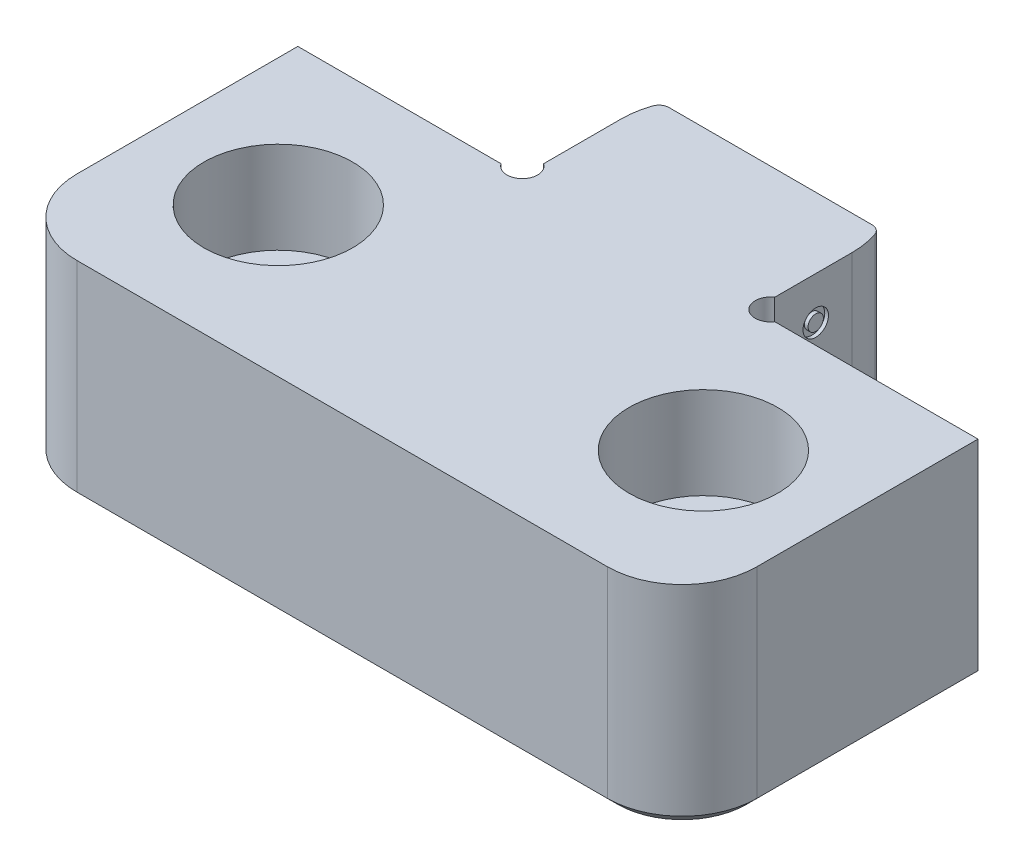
ISO-10303-21;
HEADER;
FILE_DESCRIPTION(('STEP AP214'),'2;1');
FILE_NAME('part.step','',(''),(''),'','','');
FILE_SCHEMA(('AUTOMOTIVE_DESIGN { 1 0 10303 214 1 1 1 1 }'));
ENDSEC;
DATA;
#1=APPLICATION_CONTEXT('core data for automotive mechanical design processes');
#2=APPLICATION_PROTOCOL_DEFINITION('international standard','automotive_design',2000,#1);
#3=PRODUCT_CONTEXT('',#1,'mechanical');
#4=PRODUCT('Part','Part','',(#3));
#5=PRODUCT_RELATED_PRODUCT_CATEGORY('part','',(#4));
#6=PRODUCT_DEFINITION_FORMATION('','',#4);
#7=PRODUCT_DEFINITION_CONTEXT('part definition',#1,'design');
#8=PRODUCT_DEFINITION('design','',#6,#7);
#9=PRODUCT_DEFINITION_SHAPE('','',#8);
#10=(LENGTH_UNIT() NAMED_UNIT(*) SI_UNIT(.MILLI.,.METRE.));
#11=(NAMED_UNIT(*) PLANE_ANGLE_UNIT() SI_UNIT($,.RADIAN.));
#12=(NAMED_UNIT(*) SI_UNIT($,.STERADIAN.) SOLID_ANGLE_UNIT());
#13=UNCERTAINTY_MEASURE_WITH_UNIT(LENGTH_MEASURE(1.E-05),#10,'distance_accuracy_value','');
#14=(GEOMETRIC_REPRESENTATION_CONTEXT(3) GLOBAL_UNCERTAINTY_ASSIGNED_CONTEXT((#13)) GLOBAL_UNIT_ASSIGNED_CONTEXT((#10,
#11,#12)) REPRESENTATION_CONTEXT('',''));
#15=CARTESIAN_POINT('',(0.,0.,0.));
#16=DIRECTION('',(0.,0.,1.));
#17=DIRECTION('',(1.,0.,0.));
#18=AXIS2_PLACEMENT_3D('',#15,#16,#17);
#19=CARTESIAN_POINT('',(-8.63346,-15.748,0.));
#20=DIRECTION('',(-1.,0.,0.));
#21=DIRECTION('',(0.,0.,1.));
#22=AXIS2_PLACEMENT_3D('',#19,#20,#21);
#23=PLANE('',#22);
#24=CARTESIAN_POINT('',(-8.63346,47.752,-2.286));
#25=DIRECTION('',(-1.,0.,0.));
#26=DIRECTION('',(0.,0.,1.));
#27=AXIS2_PLACEMENT_3D('',#24,#25,#26);
#28=CIRCLE('',#27,63.5);
#29=CARTESIAN_POINT('',(-8.63346,-15.748,-2.286));
#30=VERTEX_POINT('',#29);
#31=CARTESIAN_POINT('',(-8.63346,-15.5444738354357,-7.366));
#32=VERTEX_POINT('',#31);
#33=EDGE_CURVE('E344',#30,#32,#28,.F.);
#34=ORIENTED_EDGE('',*,*,#33,.F.);
#35=DIRECTION('',(0.,0.,1.));
#36=VECTOR('',#35,1.);
#37=CARTESIAN_POINT('',(-8.63346,-15.748,0.));
#38=LINE('',#37,#36);
#39=CARTESIAN_POINT('',(-8.63346,-15.748,-1.58538097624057));
#40=VERTEX_POINT('',#39);
#41=EDGE_CURVE('E283',#30,#40,#38,.T.);
#42=ORIENTED_EDGE('',*,*,#41,.T.);
#43=DIRECTION('',(0.,1.,0.));
#44=VECTOR('',#43,1.);
#45=CARTESIAN_POINT('',(-8.63346,-15.748,-1.58538097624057));
#46=LINE('',#45,#44);
#47=CARTESIAN_POINT('',(-8.63346,0.,-1.58538097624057));
#48=VERTEX_POINT('',#47);
#49=EDGE_CURVE('E267',#48,#40,#46,.F.);
#50=ORIENTED_EDGE('',*,*,#49,.F.);
#51=DIRECTION('',(0.,0.,1.));
#52=VECTOR('',#51,1.);
#53=CARTESIAN_POINT('',(-8.63346,0.,0.));
#54=LINE('',#53,#52);
#55=CARTESIAN_POINT('',(-8.63346,0.,-7.366));
#56=VERTEX_POINT('',#55);
#57=EDGE_CURVE('E294',#56,#48,#54,.T.);
#58=ORIENTED_EDGE('',*,*,#57,.F.);
#59=DIRECTION('',(0.,1.,0.));
#60=VECTOR('',#59,1.);
#61=CARTESIAN_POINT('',(-8.63346,-15.748,-7.366));
#62=LINE('',#61,#60);
#63=EDGE_CURVE('E202',#32,#56,#62,.T.);
#64=ORIENTED_EDGE('',*,*,#63,.F.);
#65=EDGE_LOOP('',(#34,#42,#50,#58,#64));
#66=FACE_BOUND('',#65,.T.);
#67=CARTESIAN_POINT('',(-8.63346,-3.175,-4.64819999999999));
#68=DIRECTION('',(1.,0.,0.));
#69=DIRECTION('',(0.,0.,-1.));
#70=AXIS2_PLACEMENT_3D('',#67,#68,#69);
#71=CIRCLE('',#70,0.9525);
#72=CARTESIAN_POINT('',(-8.63346,-3.175,-5.6007));
#73=VERTEX_POINT('',#72);
#74=EDGE_CURVE('E402',#73,#73,#71,.T.);
#75=ORIENTED_EDGE('',*,*,#74,.T.);
#76=EDGE_LOOP('',(#75));
#77=FACE_BOUND('',#76,.T.);
#78=CARTESIAN_POINT('',(-8.63346,-6.3246,-4.64819999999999));
#79=DIRECTION('',(1.,0.,0.));
#80=DIRECTION('',(0.,0.,-1.));
#81=AXIS2_PLACEMENT_3D('',#78,#79,#80);
#82=CIRCLE('',#81,0.9525);
#83=CARTESIAN_POINT('',(-8.63346,-6.3246,-5.6007));
#84=VERTEX_POINT('',#83);
#85=EDGE_CURVE('E390',#84,#84,#82,.T.);
#86=ORIENTED_EDGE('',*,*,#85,.T.);
#87=EDGE_LOOP('',(#86));
#88=FACE_BOUND('',#87,.T.);
#89=CARTESIAN_POINT('',(-8.63346,-9.4996,-4.64819999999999));
#90=DIRECTION('',(1.,0.,0.));
#91=DIRECTION('',(0.,0.,-1.));
#92=AXIS2_PLACEMENT_3D('',#89,#90,#91);
#93=CIRCLE('',#92,0.9525);
#94=CARTESIAN_POINT('',(-8.63346,-9.4996,-5.6007));
#95=VERTEX_POINT('',#94);
#96=EDGE_CURVE('E378',#95,#95,#93,.T.);
#97=ORIENTED_EDGE('',*,*,#96,.T.);
#98=EDGE_LOOP('',(#97));
#99=FACE_BOUND('',#98,.T.);
#100=CARTESIAN_POINT('',(-8.63346,-12.6746,-4.64819999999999));
#101=DIRECTION('',(1.,0.,0.));
#102=DIRECTION('',(0.,0.,-1.));
#103=AXIS2_PLACEMENT_3D('',#100,#101,#102);
#104=CIRCLE('',#103,0.9525);
#105=CARTESIAN_POINT('',(-8.63346,-12.6746,-5.6007));
#106=VERTEX_POINT('',#105);
#107=EDGE_CURVE('E367',#106,#106,#104,.T.);
#108=ORIENTED_EDGE('',*,*,#107,.T.);
#109=EDGE_LOOP('',(#108));
#110=FACE_BOUND('',#109,.T.);
#111=ADVANCED_FACE('F34',(#66,#77,#88,#99,#110),#23,.T.);
#112=CARTESIAN_POINT('',(-2.28346,-15.748,-7.366));
#113=DIRECTION('',(0.,1.,0.));
#114=DIRECTION('',(0.,0.,1.));
#115=AXIS2_PLACEMENT_3D('',#112,#113,#114);
#116=CYLINDRICAL_SURFACE('',#115,6.35);
#117=CARTESIAN_POINT('',(-8.63346,-15.5444738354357,-7.366));
#118=CARTESIAN_POINT('',(-8.63347511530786,-15.530664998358,-7.53813317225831));
#119=CARTESIAN_POINT('',(-8.62646095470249,-15.5161422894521,-7.71020394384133));
#120=CARTESIAN_POINT('',(-8.59860719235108,-15.4859037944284,-8.05198407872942));
#121=CARTESIAN_POINT('',(-8.57785764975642,-15.4701963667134,-8.22170152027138));
#122=CARTESIAN_POINT('',(-8.52276235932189,-15.4376403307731,-8.5588013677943));
#123=CARTESIAN_POINT('',(-8.4884167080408,-15.4207917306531,-8.7261837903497));
#124=CARTESIAN_POINT('',(-8.40612740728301,-15.3860213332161,-9.05863220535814));
#125=CARTESIAN_POINT('',(-8.35809636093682,-15.3680932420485,-9.22367591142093));
#126=CARTESIAN_POINT('',(-8.30344865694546,-15.3497713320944,-9.38645454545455));
#127=B_SPLINE_CURVE_WITH_KNOTS('',3,(#117,#118,#119,#120,#121,#122,#123,#124,#125,#126),
.UNSPECIFIED.,.F.,.F.,(4,2,2,2,4),(0.,0.517906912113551,1.03245124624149,1.54699192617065,
2.0648951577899),.UNSPECIFIED.);
#128=CARTESIAN_POINT('',(-8.30344865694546,-15.3497713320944,-9.38645454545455));
#129=VERTEX_POINT('',#128);
#130=EDGE_CURVE('E351',#32,#129,#127,.T.);
#131=ORIENTED_EDGE('',*,*,#130,.F.);
#132=ORIENTED_EDGE('',*,*,#63,.T.);
#133=CARTESIAN_POINT('',(-2.28346,0.,-7.366));
#134=DIRECTION('',(0.,1.,0.));
#135=DIRECTION('',(0.,0.,-1.));
#136=AXIS2_PLACEMENT_3D('',#133,#134,#135);
#137=CIRCLE('',#136,6.35);
#138=CARTESIAN_POINT('',(-8.30344865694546,0.,-9.38645454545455));
#139=VERTEX_POINT('',#138);
#140=EDGE_CURVE('E282',#139,#56,#137,.T.);
#141=ORIENTED_EDGE('',*,*,#140,.F.);
#142=DIRECTION('',(0.,1.,0.));
#143=VECTOR('',#142,1.);
#144=CARTESIAN_POINT('',(-8.30344865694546,-15.748,-9.38645454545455));
#145=LINE('',#144,#143);
#146=EDGE_CURVE('E208',#129,#139,#145,.T.);
#147=ORIENTED_EDGE('',*,*,#146,.F.);
#148=EDGE_LOOP('',(#131,#132,#141,#147));
#149=FACE_BOUND('',#148,.T.);
#150=ADVANCED_FACE('F517',(#149),#116,.T.);
#151=CARTESIAN_POINT('',(-7.58105001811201,-15.748,-9.144));
#152=DIRECTION('',(0.,1.,0.));
#153=DIRECTION('',(0.,0.,1.));
#154=AXIS2_PLACEMENT_3D('',#151,#152,#153);
#155=CYLINDRICAL_SURFACE('',#154,0.762);
#156=CARTESIAN_POINT('',(-8.30344865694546,-15.3497713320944,-9.38645454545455));
#157=CARTESIAN_POINT('',(-8.28982150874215,-15.3451910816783,-9.42716899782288));
#158=CARTESIAN_POINT('',(-8.27268791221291,-15.3407008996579,-9.46670885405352));
#159=CARTESIAN_POINT('',(-8.23202758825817,-15.3320428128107,-9.54237347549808));
#160=CARTESIAN_POINT('',(-8.20850316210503,-15.3278747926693,-9.5784994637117));
#161=CARTESIAN_POINT('',(-8.15565643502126,-15.3199976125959,-9.64631899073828));
#162=CARTESIAN_POINT('',(-8.12633110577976,-15.316288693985,-9.67801019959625));
#163=CARTESIAN_POINT('',(-8.06272629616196,-15.3094630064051,-9.73601580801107));
#164=CARTESIAN_POINT('',(-8.02844810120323,-15.3063460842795,-9.7623315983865));
#165=CARTESIAN_POINT('',(-7.95605496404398,-15.3008285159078,-9.80872307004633));
#166=CARTESIAN_POINT('',(-7.91795656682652,-15.2984249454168,-9.82882424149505));
#167=CARTESIAN_POINT('',(-7.83888248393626,-15.2944067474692,-9.86233701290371));
#168=CARTESIAN_POINT('',(-7.79790769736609,-15.292791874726,-9.87575069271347));
#169=CARTESIAN_POINT('',(-7.72743676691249,-15.2907863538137,-9.89238782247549));
#170=CARTESIAN_POINT('',(-7.69837582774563,-15.2901705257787,-9.89748841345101));
#171=CARTESIAN_POINT('',(-7.63989733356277,-15.2893482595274,-9.90429460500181));
#172=CARTESIAN_POINT('',(-7.61048037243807,-15.2891412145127,-9.90600523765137));
#173=CARTESIAN_POINT('',(-7.58105001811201,-15.2891421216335,-9.906));
#174=B_SPLINE_CURVE_WITH_KNOTS('',3,(#156,#157,#158,#159,#160,#161,#162,#163,#164,#165,#166,
#167,#168,#169,#170,#171,#172,#173),.UNSPECIFIED.,.F.,.F.,(4,2,2,2,2,2,2,2,4),(0.,
0.129368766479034,0.258691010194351,0.388080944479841,0.517437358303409,0.646255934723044,
0.775034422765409,0.86338054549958,0.951595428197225),.UNSPECIFIED.);
#175=CARTESIAN_POINT('',(-7.581050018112,-15.2891421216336,-9.906));
#176=VERTEX_POINT('',#175);
#177=EDGE_CURVE('E356',#129,#176,#174,.T.);
#178=ORIENTED_EDGE('',*,*,#177,.F.);
#179=ORIENTED_EDGE('',*,*,#146,.T.);
#180=CARTESIAN_POINT('',(-7.58105001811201,0.,-9.144));
#181=DIRECTION('',(0.,1.,0.));
#182=DIRECTION('',(0.,0.,1.));
#183=AXIS2_PLACEMENT_3D('',#180,#181,#182);
#184=CIRCLE('',#183,0.762);
#185=CARTESIAN_POINT('',(-7.58105001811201,0.,-9.906));
#186=VERTEX_POINT('',#185);
#187=EDGE_CURVE('E286',#186,#139,#184,.T.);
#188=ORIENTED_EDGE('',*,*,#187,.F.);
#189=DIRECTION('',(0.,1.,0.));
#190=VECTOR('',#189,1.);
#191=CARTESIAN_POINT('',(-7.58105001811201,-15.748,-9.906));
#192=LINE('',#191,#190);
#193=EDGE_CURVE('E324',#176,#186,#192,.T.);
#194=ORIENTED_EDGE('',*,*,#193,.F.);
#195=EDGE_LOOP('',(#178,#179,#188,#194));
#196=FACE_BOUND('',#195,.T.);
#197=ADVANCED_FACE('F524',(#196),#155,.T.);
#198=CARTESIAN_POINT('',(-7.58105001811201,-15.748,-9.906));
#199=DIRECTION('',(0.,0.,-1.));
#200=DIRECTION('',(-1.,0.,0.));
#201=AXIS2_PLACEMENT_3D('',#198,#199,#200);
#202=PLANE('',#201);
#203=DIRECTION('',(1.,0.,0.));
#204=VECTOR('',#203,1.);
#205=CARTESIAN_POINT('',(-25.4,-15.2891421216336,-9.906));
#206=LINE('',#205,#204);
#207=CARTESIAN_POINT('',(7.58105001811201,-15.2891421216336,-9.906));
#208=VERTEX_POINT('',#207);
#209=EDGE_CURVE('E175',#176,#208,#206,.T.);
#210=ORIENTED_EDGE('',*,*,#209,.F.);
#211=ORIENTED_EDGE('',*,*,#193,.T.);
#212=DIRECTION('',(-1.,0.,0.));
#213=VECTOR('',#212,1.);
#214=CARTESIAN_POINT('',(-7.58105001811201,0.,-9.906));
#215=LINE('',#214,#213);
#216=CARTESIAN_POINT('',(7.58105001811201,0.,-9.906));
#217=VERTEX_POINT('',#216);
#218=EDGE_CURVE('E318',#217,#186,#215,.T.);
#219=ORIENTED_EDGE('',*,*,#218,.F.);
#220=DIRECTION('',(0.,1.,0.));
#221=VECTOR('',#220,1.);
#222=CARTESIAN_POINT('',(7.58105001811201,-15.748,-9.906));
#223=LINE('',#222,#221);
#224=EDGE_CURVE('E195',#208,#217,#223,.T.);
#225=ORIENTED_EDGE('',*,*,#224,.F.);
#226=EDGE_LOOP('',(#210,#211,#219,#225));
#227=FACE_BOUND('',#226,.T.);
#228=ADVANCED_FACE('F332',(#227),#202,.T.);
#229=CARTESIAN_POINT('',(7.58105001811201,-15.748,-9.144));
#230=DIRECTION('',(0.,1.,0.));
#231=DIRECTION('',(0.,0.,1.));
#232=AXIS2_PLACEMENT_3D('',#229,#230,#231);
#233=CYLINDRICAL_SURFACE('',#232,0.762);
#234=CARTESIAN_POINT('',(7.58105001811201,-15.2891421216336,-9.906));
#235=CARTESIAN_POINT('',(7.62369767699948,-15.2891363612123,-9.90603746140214));
#236=CARTESIAN_POINT('',(7.6663325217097,-15.2895745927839,-9.90242196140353));
#237=CARTESIAN_POINT('',(7.75035783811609,-15.2912963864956,-9.88816241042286));
#238=CARTESIAN_POINT('',(7.79174932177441,-15.2925792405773,-9.87752424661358));
#239=CARTESIAN_POINT('',(7.87215793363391,-15.2959483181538,-9.84949122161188));
#240=CARTESIAN_POINT('',(7.91117426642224,-15.2980348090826,-9.8320941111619));
#241=CARTESIAN_POINT('',(7.98572019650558,-15.302931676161,-9.79106623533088));
#242=CARTESIAN_POINT('',(8.0212502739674,-15.3057419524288,-9.7674363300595));
#243=CARTESIAN_POINT('',(8.08796169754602,-15.3119965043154,-9.71452975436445));
#244=CARTESIAN_POINT('',(8.11912716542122,-15.3154429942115,-9.68523334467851));
#245=CARTESIAN_POINT('',(8.17610397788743,-15.3228435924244,-9.62187896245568));
#246=CARTESIAN_POINT('',(8.20191608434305,-15.3267976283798,-9.58782166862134));
#247=CARTESIAN_POINT('',(8.24110142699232,-15.3339192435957,-9.52599113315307));
#248=CARTESIAN_POINT('',(8.25593520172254,-15.3369979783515,-9.49911999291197));
#249=CARTESIAN_POINT('',(8.28224368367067,-15.3432929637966,-9.44384794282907));
#250=CARTESIAN_POINT('',(8.29372357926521,-15.3465089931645,-9.41544947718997));
#251=CARTESIAN_POINT('',(8.30344865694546,-15.3497713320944,-9.38645454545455));
#252=B_SPLINE_CURVE_WITH_KNOTS('',3,(#234,#235,#236,#237,#238,#239,#240,#241,#242,#243,#244,
#245,#246,#247,#248,#249,#250,#251),.UNSPECIFIED.,.F.,.F.,(4,2,2,2,2,2,2,2,4),(0.,
0.127769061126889,0.255431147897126,0.383135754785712,0.510822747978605,0.638962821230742,
0.767084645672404,0.859417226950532,0.951606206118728),.UNSPECIFIED.);
#253=CARTESIAN_POINT('',(8.30344865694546,-15.3497713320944,-9.38645454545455));
#254=VERTEX_POINT('',#253);
#255=EDGE_CURVE('E171',#208,#254,#252,.T.);
#256=ORIENTED_EDGE('',*,*,#255,.F.);
#257=ORIENTED_EDGE('',*,*,#224,.T.);
#258=CARTESIAN_POINT('',(7.58105001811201,0.,-9.144));
#259=DIRECTION('',(0.,1.,0.));
#260=DIRECTION('',(0.,0.,-1.));
#261=AXIS2_PLACEMENT_3D('',#258,#259,#260);
#262=CIRCLE('',#261,0.762);
#263=CARTESIAN_POINT('',(8.30344865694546,0.,-9.38645454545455));
#264=VERTEX_POINT('',#263);
#265=EDGE_CURVE('E315',#264,#217,#262,.T.);
#266=ORIENTED_EDGE('',*,*,#265,.F.);
#267=DIRECTION('',(0.,1.,0.));
#268=VECTOR('',#267,1.);
#269=CARTESIAN_POINT('',(8.30344865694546,-15.748,-9.38645454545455));
#270=LINE('',#269,#268);
#271=EDGE_CURVE('E192',#254,#264,#270,.T.);
#272=ORIENTED_EDGE('',*,*,#271,.F.);
#273=EDGE_LOOP('',(#256,#257,#266,#272));
#274=FACE_BOUND('',#273,.T.);
#275=ADVANCED_FACE('F329',(#274),#233,.T.);
#276=CARTESIAN_POINT('',(2.28346,-15.748,-7.366));
#277=DIRECTION('',(0.,1.,0.));
#278=DIRECTION('',(0.,0.,1.));
#279=AXIS2_PLACEMENT_3D('',#276,#277,#278);
#280=CYLINDRICAL_SURFACE('',#279,6.35);
#281=CARTESIAN_POINT('',(8.30344865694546,-15.3497713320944,-9.38645454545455));
#282=CARTESIAN_POINT('',(8.35809636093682,-15.3680932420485,-9.22367591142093));
#283=CARTESIAN_POINT('',(8.40612740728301,-15.3860213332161,-9.05863220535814));
#284=CARTESIAN_POINT('',(8.4884167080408,-15.4207917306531,-8.7261837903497));
#285=CARTESIAN_POINT('',(8.52276235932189,-15.4376403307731,-8.5588013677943));
#286=CARTESIAN_POINT('',(8.57785764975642,-15.4701963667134,-8.22170152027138));
#287=CARTESIAN_POINT('',(8.59860719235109,-15.4859037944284,-8.05198407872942));
#288=CARTESIAN_POINT('',(8.6264609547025,-15.5161422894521,-7.71020394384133));
#289=CARTESIAN_POINT('',(8.63347511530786,-15.530664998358,-7.53813317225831));
#290=CARTESIAN_POINT('',(8.63346,-15.5444738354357,-7.366));
#291=B_SPLINE_CURVE_WITH_KNOTS('',3,(#281,#282,#283,#284,#285,#286,#287,#288,#289,#290),
.UNSPECIFIED.,.F.,.F.,(4,2,2,2,4),(0.,0.517903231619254,1.03244391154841,1.54698824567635,
2.0648951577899),.UNSPECIFIED.);
#292=CARTESIAN_POINT('',(8.63346,-15.5444738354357,-7.366));
#293=VERTEX_POINT('',#292);
#294=EDGE_CURVE('E168',#254,#293,#291,.T.);
#295=ORIENTED_EDGE('',*,*,#294,.F.);
#296=ORIENTED_EDGE('',*,*,#271,.T.);
#297=CARTESIAN_POINT('',(2.28346,0.,-7.366));
#298=DIRECTION('',(0.,1.,0.));
#299=DIRECTION('',(0.,0.,1.));
#300=AXIS2_PLACEMENT_3D('',#297,#298,#299);
#301=CIRCLE('',#300,6.35);
#302=CARTESIAN_POINT('',(8.63346,0.,-7.366));
#303=VERTEX_POINT('',#302);
#304=EDGE_CURVE('E191',#303,#264,#301,.T.);
#305=ORIENTED_EDGE('',*,*,#304,.F.);
#306=DIRECTION('',(0.,1.,0.));
#307=VECTOR('',#306,1.);
#308=CARTESIAN_POINT('',(8.63346,-15.748,-7.366));
#309=LINE('',#308,#307);
#310=EDGE_CURVE('E182',#293,#303,#309,.T.);
#311=ORIENTED_EDGE('',*,*,#310,.F.);
#312=EDGE_LOOP('',(#295,#296,#305,#311));
#313=FACE_BOUND('',#312,.T.);
#314=ADVANCED_FACE('F189',(#313),#280,.T.);
#315=CARTESIAN_POINT('',(8.63346,-15.748,0.));
#316=DIRECTION('',(1.,0.,0.));
#317=DIRECTION('',(0.,0.,-1.));
#318=AXIS2_PLACEMENT_3D('',#315,#316,#317);
#319=PLANE('',#318);
#320=CARTESIAN_POINT('',(8.63346,47.752,-2.286));
#321=DIRECTION('',(-1.,0.,0.));
#322=DIRECTION('',(0.,0.,-1.));
#323=AXIS2_PLACEMENT_3D('',#320,#321,#322);
#324=CIRCLE('',#323,63.5);
#325=CARTESIAN_POINT('',(8.63346,-15.748,-2.286));
#326=VERTEX_POINT('',#325);
#327=EDGE_CURVE('E48',#293,#326,#324,.T.);
#328=ORIENTED_EDGE('',*,*,#327,.F.);
#329=ORIENTED_EDGE('',*,*,#310,.T.);
#330=DIRECTION('',(0.,0.,-1.));
#331=VECTOR('',#330,1.);
#332=CARTESIAN_POINT('',(8.63346,0.,0.));
#333=LINE('',#332,#331);
#334=CARTESIAN_POINT('',(8.63346,0.,-1.58538097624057));
#335=VERTEX_POINT('',#334);
#336=EDGE_CURVE('E312',#335,#303,#333,.T.);
#337=ORIENTED_EDGE('',*,*,#336,.F.);
#338=DIRECTION('',(0.,1.,0.));
#339=VECTOR('',#338,1.);
#340=CARTESIAN_POINT('',(8.63346,-15.748,-1.58538097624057));
#341=LINE('',#340,#339);
#342=CARTESIAN_POINT('',(8.63346,-15.748,-1.58538097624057));
#343=VERTEX_POINT('',#342);
#344=EDGE_CURVE('E280',#343,#335,#341,.T.);
#345=ORIENTED_EDGE('',*,*,#344,.F.);
#346=DIRECTION('',(0.,0.,-1.));
#347=VECTOR('',#346,1.);
#348=CARTESIAN_POINT('',(8.63346,-15.748,0.));
#349=LINE('',#348,#347);
#350=EDGE_CURVE('E186',#343,#326,#349,.T.);
#351=ORIENTED_EDGE('',*,*,#350,.T.);
#352=EDGE_LOOP('',(#328,#329,#337,#345,#351));
#353=FACE_BOUND('',#352,.T.);
#354=CARTESIAN_POINT('',(8.63346,-12.6746,-4.64819999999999));
#355=DIRECTION('',(1.,0.,0.));
#356=DIRECTION('',(0.,0.,-1.));
#357=AXIS2_PLACEMENT_3D('',#354,#355,#356);
#358=CIRCLE('',#357,0.9525);
#359=CARTESIAN_POINT('',(8.63346,-12.6746,-5.6007));
#360=VERTEX_POINT('',#359);
#361=EDGE_CURVE('E414',#360,#360,#358,.T.);
#362=ORIENTED_EDGE('',*,*,#361,.F.);
#363=EDGE_LOOP('',(#362));
#364=FACE_BOUND('',#363,.T.);
#365=CARTESIAN_POINT('',(8.63346,-9.4996,-4.64819999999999));
#366=DIRECTION('',(1.,0.,0.));
#367=DIRECTION('',(0.,0.,-1.));
#368=AXIS2_PLACEMENT_3D('',#365,#366,#367);
#369=CIRCLE('',#368,0.9525);
#370=CARTESIAN_POINT('',(8.63346,-9.4996,-5.6007));
#371=VERTEX_POINT('',#370);
#372=EDGE_CURVE('E426',#371,#371,#369,.T.);
#373=ORIENTED_EDGE('',*,*,#372,.F.);
#374=EDGE_LOOP('',(#373));
#375=FACE_BOUND('',#374,.T.);
#376=CARTESIAN_POINT('',(8.63346,-6.3246,-4.64819999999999));
#377=DIRECTION('',(1.,0.,0.));
#378=DIRECTION('',(0.,0.,-1.));
#379=AXIS2_PLACEMENT_3D('',#376,#377,#378);
#380=CIRCLE('',#379,0.9525);
#381=CARTESIAN_POINT('',(8.63346,-6.3246,-5.6007));
#382=VERTEX_POINT('',#381);
#383=EDGE_CURVE('E438',#382,#382,#380,.T.);
#384=ORIENTED_EDGE('',*,*,#383,.F.);
#385=EDGE_LOOP('',(#384));
#386=FACE_BOUND('',#385,.T.);
#387=CARTESIAN_POINT('',(8.63346,-3.175,-4.64819999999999));
#388=DIRECTION('',(1.,0.,0.));
#389=DIRECTION('',(0.,0.,-1.));
#390=AXIS2_PLACEMENT_3D('',#387,#388,#389);
#391=CIRCLE('',#390,0.9525);
#392=CARTESIAN_POINT('',(8.63346,-3.175,-5.6007));
#393=VERTEX_POINT('',#392);
#394=EDGE_CURVE('E450',#393,#393,#391,.T.);
#395=ORIENTED_EDGE('',*,*,#394,.F.);
#396=EDGE_LOOP('',(#395));
#397=FACE_BOUND('',#396,.T.);
#398=ADVANCED_FACE('F179',(#353,#364,#375,#386,#397),#319,.T.);
#399=CARTESIAN_POINT('',(8.63346,-15.748,0.));
#400=DIRECTION('',(0.,0.,-1.));
#401=DIRECTION('',(-1.,0.,0.));
#402=AXIS2_PLACEMENT_3D('',#399,#400,#401);
#403=PLANE('',#402);
#404=DIRECTION('',(0.,1.,0.));
#405=VECTOR('',#404,1.);
#406=CARTESIAN_POINT('',(25.4,-15.748,0.));
#407=LINE('',#406,#405);
#408=CARTESIAN_POINT('',(25.4,-14.986,0.));
#409=VERTEX_POINT('',#408);
#410=CARTESIAN_POINT('',(25.4,0.,0.));
#411=VERTEX_POINT('',#410);
#412=EDGE_CURVE('E193',#409,#411,#407,.T.);
#413=ORIENTED_EDGE('',*,*,#412,.F.);
#414=DIRECTION('',(0.707106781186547,0.707106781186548,0.));
#415=VECTOR('',#414,1.);
#416=CARTESIAN_POINT('',(16.63573,-23.75027,0.));
#417=LINE('',#416,#415);
#418=CARTESIAN_POINT('',(24.638,-15.748,0.));
#419=VERTEX_POINT('',#418);
#420=EDGE_CURVE('E238',#409,#419,#417,.F.);
#421=ORIENTED_EDGE('',*,*,#420,.T.);
#422=DIRECTION('',(-1.,0.,0.));
#423=VECTOR('',#422,1.);
#424=CARTESIAN_POINT('',(8.63346,-15.748,0.));
#425=LINE('',#424,#423);
#426=CARTESIAN_POINT('',(10.2188409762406,-15.748,0.));
#427=VERTEX_POINT('',#426);
#428=EDGE_CURVE('E289',#419,#427,#425,.T.);
#429=ORIENTED_EDGE('',*,*,#428,.T.);
#430=DIRECTION('',(0.,1.,0.));
#431=VECTOR('',#430,1.);
#432=CARTESIAN_POINT('',(10.2188409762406,-15.748,0.));
#433=LINE('',#432,#431);
#434=CARTESIAN_POINT('',(10.2188409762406,0.,0.));
#435=VERTEX_POINT('',#434);
#436=EDGE_CURVE('E277',#435,#427,#433,.F.);
#437=ORIENTED_EDGE('',*,*,#436,.F.);
#438=DIRECTION('',(-1.,0.,0.));
#439=VECTOR('',#438,1.);
#440=CARTESIAN_POINT('',(8.63346,0.,0.));
#441=LINE('',#440,#439);
#442=EDGE_CURVE('E309',#411,#435,#441,.T.);
#443=ORIENTED_EDGE('',*,*,#442,.F.);
#444=EDGE_LOOP('',(#413,#421,#429,#437,#443));
#445=FACE_BOUND('',#444,.T.);
#446=ADVANCED_FACE('F705',(#445),#403,.T.);
#447=CARTESIAN_POINT('',(25.4,-15.748,0.));
#448=DIRECTION('',(1.,0.,0.));
#449=DIRECTION('',(0.,0.,-1.));
#450=AXIS2_PLACEMENT_3D('',#447,#448,#449);
#451=PLANE('',#450);
#452=DIRECTION('',(0.,1.,0.));
#453=VECTOR('',#452,1.);
#454=CARTESIAN_POINT('',(25.4,-15.748,16.51));
#455=LINE('',#454,#453);
#456=CARTESIAN_POINT('',(25.4,0.,16.51));
#457=VERTEX_POINT('',#456);
#458=CARTESIAN_POINT('',(25.4,-14.986,16.51));
#459=VERTEX_POINT('',#458);
#460=EDGE_CURVE('E216',#457,#459,#455,.F.);
#461=ORIENTED_EDGE('',*,*,#460,.T.);
#462=DIRECTION('',(0.,0.,-1.));
#463=VECTOR('',#462,1.);
#464=CARTESIAN_POINT('',(25.4,-14.986,0.));
#465=LINE('',#464,#463);
#466=EDGE_CURVE('E236',#459,#409,#465,.T.);
#467=ORIENTED_EDGE('',*,*,#466,.T.);
#468=ORIENTED_EDGE('',*,*,#412,.T.);
#469=DIRECTION('',(0.,0.,-1.));
#470=VECTOR('',#469,1.);
#471=CARTESIAN_POINT('',(25.4,0.,0.));
#472=LINE('',#471,#470);
#473=EDGE_CURVE('E306',#457,#411,#472,.T.);
#474=ORIENTED_EDGE('',*,*,#473,.F.);
#475=EDGE_LOOP('',(#461,#467,#468,#474));
#476=FACE_BOUND('',#475,.T.);
#477=ADVANCED_FACE('F699',(#476),#451,.T.);
#478=CARTESIAN_POINT('',(-25.4,-15.748,22.098));
#479=DIRECTION('',(0.,0.,1.));
#480=DIRECTION('',(1.,0.,0.));
#481=AXIS2_PLACEMENT_3D('',#478,#479,#480);
#482=PLANE('',#481);
#483=DIRECTION('',(0.,1.,0.));
#484=VECTOR('',#483,1.);
#485=CARTESIAN_POINT('',(-19.812,-15.748,22.098));
#486=LINE('',#485,#484);
#487=CARTESIAN_POINT('',(-19.812,0.,22.098));
#488=VERTEX_POINT('',#487);
#489=CARTESIAN_POINT('',(-19.812,-14.986,22.098));
#490=VERTEX_POINT('',#489);
#491=EDGE_CURVE('E207',#488,#490,#486,.F.);
#492=ORIENTED_EDGE('',*,*,#491,.T.);
#493=DIRECTION('',(1.,0.,0.));
#494=VECTOR('',#493,1.);
#495=CARTESIAN_POINT('',(-25.4,-14.986,22.098));
#496=LINE('',#495,#494);
#497=CARTESIAN_POINT('',(19.812,-14.986,22.098));
#498=VERTEX_POINT('',#497);
#499=EDGE_CURVE('E42',#490,#498,#496,.T.);
#500=ORIENTED_EDGE('',*,*,#499,.T.);
#501=DIRECTION('',(0.,1.,0.));
#502=VECTOR('',#501,1.);
#503=CARTESIAN_POINT('',(19.812,-15.748,22.098));
#504=LINE('',#503,#502);
#505=CARTESIAN_POINT('',(19.812,0.,22.098));
#506=VERTEX_POINT('',#505);
#507=EDGE_CURVE('E210',#498,#506,#504,.T.);
#508=ORIENTED_EDGE('',*,*,#507,.T.);
#509=DIRECTION('',(1.,0.,0.));
#510=VECTOR('',#509,1.);
#511=CARTESIAN_POINT('',(-25.4,0.,22.098));
#512=LINE('',#511,#510);
#513=EDGE_CURVE('E303',#488,#506,#512,.T.);
#514=ORIENTED_EDGE('',*,*,#513,.F.);
#515=EDGE_LOOP('',(#492,#500,#508,#514));
#516=FACE_BOUND('',#515,.T.);
#517=ADVANCED_FACE('F688',(#516),#482,.T.);
#518=CARTESIAN_POINT('',(-25.4,-15.748,0.));
#519=DIRECTION('',(-1.,0.,0.));
#520=DIRECTION('',(0.,0.,1.));
#521=AXIS2_PLACEMENT_3D('',#518,#519,#520);
#522=PLANE('',#521);
#523=DIRECTION('',(0.,1.,0.));
#524=VECTOR('',#523,1.);
#525=CARTESIAN_POINT('',(-25.4,-15.748,0.));
#526=LINE('',#525,#524);
#527=CARTESIAN_POINT('',(-25.4,-14.986,0.));
#528=VERTEX_POINT('',#527);
#529=CARTESIAN_POINT('',(-25.4,0.,0.));
#530=VERTEX_POINT('',#529);
#531=EDGE_CURVE('E197',#528,#530,#526,.T.);
#532=ORIENTED_EDGE('',*,*,#531,.F.);
#533=DIRECTION('',(0.,0.,1.));
#534=VECTOR('',#533,1.);
#535=CARTESIAN_POINT('',(-25.4,-14.986,0.));
#536=LINE('',#535,#534);
#537=CARTESIAN_POINT('',(-25.4,-14.986,16.51));
#538=VERTEX_POINT('',#537);
#539=EDGE_CURVE('E221',#528,#538,#536,.T.);
#540=ORIENTED_EDGE('',*,*,#539,.T.);
#541=DIRECTION('',(0.,1.,0.));
#542=VECTOR('',#541,1.);
#543=CARTESIAN_POINT('',(-25.4,-15.748,16.51));
#544=LINE('',#543,#542);
#545=CARTESIAN_POINT('',(-25.4,0.,16.51));
#546=VERTEX_POINT('',#545);
#547=EDGE_CURVE('E219',#538,#546,#544,.T.);
#548=ORIENTED_EDGE('',*,*,#547,.T.);
#549=DIRECTION('',(0.,0.,1.));
#550=VECTOR('',#549,1.);
#551=CARTESIAN_POINT('',(-25.4,0.,0.));
#552=LINE('',#551,#550);
#553=EDGE_CURVE('E300',#530,#546,#552,.T.);
#554=ORIENTED_EDGE('',*,*,#553,.F.);
#555=EDGE_LOOP('',(#532,#540,#548,#554));
#556=FACE_BOUND('',#555,.T.);
#557=ADVANCED_FACE('F674',(#556),#522,.T.);
#558=CARTESIAN_POINT('',(-8.63346,-15.748,0.));
#559=DIRECTION('',(0.,0.,-1.));
#560=DIRECTION('',(-1.,0.,0.));
#561=AXIS2_PLACEMENT_3D('',#558,#559,#560);
#562=PLANE('',#561);
#563=DIRECTION('',(-1.,0.,0.));
#564=VECTOR('',#563,1.);
#565=CARTESIAN_POINT('',(-8.63346,-15.748,0.));
#566=LINE('',#565,#564);
#567=CARTESIAN_POINT('',(-10.2188409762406,-15.748,0.));
#568=VERTEX_POINT('',#567);
#569=CARTESIAN_POINT('',(-24.638,-15.748,0.));
#570=VERTEX_POINT('',#569);
#571=EDGE_CURVE('E285',#568,#570,#566,.T.);
#572=ORIENTED_EDGE('',*,*,#571,.T.);
#573=DIRECTION('',(0.707106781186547,-0.707106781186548,0.));
#574=VECTOR('',#573,1.);
#575=CARTESIAN_POINT('',(-16.63573,-23.75027,0.));
#576=LINE('',#575,#574);
#577=EDGE_CURVE('E234',#570,#528,#576,.F.);
#578=ORIENTED_EDGE('',*,*,#577,.T.);
#579=ORIENTED_EDGE('',*,*,#531,.T.);
#580=DIRECTION('',(-1.,0.,0.));
#581=VECTOR('',#580,1.);
#582=CARTESIAN_POINT('',(-8.63346,0.,0.));
#583=LINE('',#582,#581);
#584=CARTESIAN_POINT('',(-10.2188409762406,0.,0.));
#585=VERTEX_POINT('',#584);
#586=EDGE_CURVE('E297',#585,#530,#583,.T.);
#587=ORIENTED_EDGE('',*,*,#586,.F.);
#588=DIRECTION('',(0.,1.,0.));
#589=VECTOR('',#588,1.);
#590=CARTESIAN_POINT('',(-10.2188409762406,-15.748,0.));
#591=LINE('',#590,#589);
#592=EDGE_CURVE('E272',#568,#585,#591,.T.);
#593=ORIENTED_EDGE('',*,*,#592,.F.);
#594=EDGE_LOOP('',(#572,#578,#579,#587,#593));
#595=FACE_BOUND('',#594,.T.);
#596=ADVANCED_FACE('F512',(#595),#562,.T.);
#597=CARTESIAN_POINT('',(-2.28346,-15.748,-7.366));
#598=DIRECTION('',(0.,-1.,0.));
#599=DIRECTION('',(0.,0.,-1.));
#600=AXIS2_PLACEMENT_3D('',#597,#598,#599);
#601=PLANE('',#600);
#602=DIRECTION('',(1.,0.,0.));
#603=VECTOR('',#602,1.);
#604=CARTESIAN_POINT('',(-25.4,-15.748,-2.286));
#605=LINE('',#604,#603);
#606=EDGE_CURVE('E11',#326,#30,#605,.F.);
#607=ORIENTED_EDGE('',*,*,#606,.F.);
#608=ORIENTED_EDGE('',*,*,#350,.F.);
#609=CARTESIAN_POINT('',(9.26846,-15.748,-0.63499999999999));
#610=DIRECTION('',(0.,1.,0.));
#611=DIRECTION('',(0.,0.,1.));
#612=AXIS2_PLACEMENT_3D('',#609,#610,#611);
#613=CIRCLE('',#612,1.143);
#614=EDGE_CURVE('E274',#343,#427,#613,.T.);
#615=ORIENTED_EDGE('',*,*,#614,.T.);
#616=ORIENTED_EDGE('',*,*,#428,.F.);
#617=DIRECTION('',(0.,0.,1.));
#618=VECTOR('',#617,1.);
#619=CARTESIAN_POINT('',(24.638,-15.748,-7.366));
#620=LINE('',#619,#618);
#621=CARTESIAN_POINT('',(24.638,-15.748,16.51));
#622=VERTEX_POINT('',#621);
#623=EDGE_CURVE('E230',#419,#622,#620,.T.);
#624=ORIENTED_EDGE('',*,*,#623,.T.);
#625=CARTESIAN_POINT('',(19.812,-15.748,16.51));
#626=DIRECTION('',(0.,-1.,0.));
#627=DIRECTION('',(0.,0.,-1.));
#628=AXIS2_PLACEMENT_3D('',#625,#626,#627);
#629=CIRCLE('',#628,4.826);
#630=CARTESIAN_POINT('',(19.812,-15.748,21.336));
#631=VERTEX_POINT('',#630);
#632=EDGE_CURVE('E226',#622,#631,#629,.T.);
#633=ORIENTED_EDGE('',*,*,#632,.T.);
#634=DIRECTION('',(-1.,0.,0.));
#635=VECTOR('',#634,1.);
#636=CARTESIAN_POINT('',(-2.28346,-15.748,21.336));
#637=LINE('',#636,#635);
#638=CARTESIAN_POINT('',(-19.812,-15.748,21.336));
#639=VERTEX_POINT('',#638);
#640=EDGE_CURVE('E224',#631,#639,#637,.T.);
#641=ORIENTED_EDGE('',*,*,#640,.T.);
#642=CARTESIAN_POINT('',(-19.812,-15.748,16.51));
#643=DIRECTION('',(0.,-1.,0.));
#644=DIRECTION('',(0.,0.,-1.));
#645=AXIS2_PLACEMENT_3D('',#642,#643,#644);
#646=CIRCLE('',#645,4.826);
#647=CARTESIAN_POINT('',(-24.638,-15.748,16.51));
#648=VERTEX_POINT('',#647);
#649=EDGE_CURVE('E228',#639,#648,#646,.T.);
#650=ORIENTED_EDGE('',*,*,#649,.T.);
#651=DIRECTION('',(0.,0.,-1.));
#652=VECTOR('',#651,1.);
#653=CARTESIAN_POINT('',(-24.638,-15.748,-7.366));
#654=LINE('',#653,#652);
#655=EDGE_CURVE('E232',#648,#570,#654,.T.);
#656=ORIENTED_EDGE('',*,*,#655,.T.);
#657=ORIENTED_EDGE('',*,*,#571,.F.);
#658=CARTESIAN_POINT('',(-9.26846,-15.748,-0.63499999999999));
#659=DIRECTION('',(0.,1.,0.));
#660=DIRECTION('',(0.,0.,-1.));
#661=AXIS2_PLACEMENT_3D('',#658,#659,#660);
#662=CIRCLE('',#661,1.143);
#663=EDGE_CURVE('E260',#568,#40,#662,.T.);
#664=ORIENTED_EDGE('',*,*,#663,.T.);
#665=ORIENTED_EDGE('',*,*,#41,.F.);
#666=EDGE_LOOP('',(#607,#608,#615,#616,#624,#633,#641,#650,#656,#657,#664,#665));
#667=FACE_BOUND('',#666,.T.);
#668=CARTESIAN_POINT('',(-15.875,-15.748,10.9855));
#669=DIRECTION('',(0.,1.,0.));
#670=DIRECTION('',(0.,0.,1.));
#671=AXIS2_PLACEMENT_3D('',#668,#669,#670);
#672=CIRCLE('',#671,3.5687);
#673=CARTESIAN_POINT('',(-15.875,-15.748,14.5542));
#674=VERTEX_POINT('',#673);
#675=EDGE_CURVE('E467',#674,#674,#672,.T.);
#676=ORIENTED_EDGE('',*,*,#675,.T.);
#677=EDGE_LOOP('',(#676));
#678=FACE_BOUND('',#677,.T.);
#679=CARTESIAN_POINT('',(15.875,-15.748,10.9855));
#680=DIRECTION('',(0.,1.,0.));
#681=DIRECTION('',(0.,0.,1.));
#682=AXIS2_PLACEMENT_3D('',#679,#680,#681);
#683=CIRCLE('',#682,3.5687);
#684=CARTESIAN_POINT('',(15.875,-15.748,14.5542));
#685=VERTEX_POINT('',#684);
#686=EDGE_CURVE('E248',#685,#685,#683,.T.);
#687=ORIENTED_EDGE('',*,*,#686,.T.);
#688=EDGE_LOOP('',(#687));
#689=FACE_BOUND('',#688,.T.);
#690=ADVANCED_FACE('F339',(#667,#678,#689),#601,.T.);
#691=CARTESIAN_POINT('',(-2.28346,0.,-7.366));
#692=DIRECTION('',(0.,-1.,0.));
#693=DIRECTION('',(0.,0.,-1.));
#694=AXIS2_PLACEMENT_3D('',#691,#692,#693);
#695=PLANE('',#694);
#696=CARTESIAN_POINT('',(-15.875,0.,10.9855));
#697=DIRECTION('',(0.,1.,0.));
#698=DIRECTION('',(0.,0.,1.));
#699=AXIS2_PLACEMENT_3D('',#696,#697,#698);
#700=CIRCLE('',#699,5.55625);
#701=CARTESIAN_POINT('',(-15.875,0.,16.54175));
#702=VERTEX_POINT('',#701);
#703=EDGE_CURVE('E456',#702,#702,#700,.T.);
#704=ORIENTED_EDGE('',*,*,#703,.F.);
#705=EDGE_LOOP('',(#704));
#706=FACE_BOUND('',#705,.T.);
#707=CARTESIAN_POINT('',(15.875,0.,10.9855));
#708=DIRECTION('',(0.,1.,0.));
#709=DIRECTION('',(0.,0.,1.));
#710=AXIS2_PLACEMENT_3D('',#707,#708,#709);
#711=CIRCLE('',#710,5.55625);
#712=CARTESIAN_POINT('',(15.875,0.,16.54175));
#713=VERTEX_POINT('',#712);
#714=EDGE_CURVE('E470',#713,#713,#711,.T.);
#715=ORIENTED_EDGE('',*,*,#714,.F.);
#716=EDGE_LOOP('',(#715));
#717=FACE_BOUND('',#716,.T.);
#718=ORIENTED_EDGE('',*,*,#513,.T.);
#719=CARTESIAN_POINT('',(19.812,0.,16.51));
#720=DIRECTION('',(0.,-1.,0.));
#721=DIRECTION('',(0.,0.,-1.));
#722=AXIS2_PLACEMENT_3D('',#719,#720,#721);
#723=CIRCLE('',#722,5.588);
#724=EDGE_CURVE('E214',#506,#457,#723,.F.);
#725=ORIENTED_EDGE('',*,*,#724,.T.);
#726=ORIENTED_EDGE('',*,*,#473,.T.);
#727=ORIENTED_EDGE('',*,*,#442,.T.);
#728=CARTESIAN_POINT('',(9.26846,0.,-0.63499999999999));
#729=DIRECTION('',(0.,-1.,0.));
#730=DIRECTION('',(0.,0.,-1.));
#731=AXIS2_PLACEMENT_3D('',#728,#729,#730);
#732=CIRCLE('',#731,1.143);
#733=EDGE_CURVE('E204',#435,#335,#732,.T.);
#734=ORIENTED_EDGE('',*,*,#733,.T.);
#735=ORIENTED_EDGE('',*,*,#336,.T.);
#736=ORIENTED_EDGE('',*,*,#304,.T.);
#737=ORIENTED_EDGE('',*,*,#265,.T.);
#738=ORIENTED_EDGE('',*,*,#218,.T.);
#739=ORIENTED_EDGE('',*,*,#187,.T.);
#740=ORIENTED_EDGE('',*,*,#140,.T.);
#741=ORIENTED_EDGE('',*,*,#57,.T.);
#742=CARTESIAN_POINT('',(-9.26846,0.,-0.63499999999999));
#743=DIRECTION('',(0.,1.,0.));
#744=DIRECTION('',(0.,0.,-1.));
#745=AXIS2_PLACEMENT_3D('',#742,#743,#744);
#746=CIRCLE('',#745,1.143);
#747=EDGE_CURVE('E255',#585,#48,#746,.T.);
#748=ORIENTED_EDGE('',*,*,#747,.F.);
#749=ORIENTED_EDGE('',*,*,#586,.T.);
#750=ORIENTED_EDGE('',*,*,#553,.T.);
#751=CARTESIAN_POINT('',(-19.812,0.,16.51));
#752=DIRECTION('',(0.,-1.,0.));
#753=DIRECTION('',(0.,0.,-1.));
#754=AXIS2_PLACEMENT_3D('',#751,#752,#753);
#755=CIRCLE('',#754,5.588);
#756=EDGE_CURVE('E212',#546,#488,#755,.F.);
#757=ORIENTED_EDGE('',*,*,#756,.T.);
#758=EDGE_LOOP('',(#718,#725,#726,#727,#734,#735,#736,#737,#738,#739,#740,#741,#748,#749,#750,#757));
#759=FACE_BOUND('',#758,.T.);
#760=ADVANCED_FACE('F336',(#706,#717,#759),#695,.F.);
#761=CARTESIAN_POINT('',(9.26846,-15.748,-0.63499999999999));
#762=DIRECTION('',(0.,1.,0.));
#763=DIRECTION('',(0.,0.,1.));
#764=AXIS2_PLACEMENT_3D('',#761,#762,#763);
#765=CYLINDRICAL_SURFACE('',#764,1.143);
#766=ORIENTED_EDGE('',*,*,#344,.T.);
#767=ORIENTED_EDGE('',*,*,#733,.F.);
#768=ORIENTED_EDGE('',*,*,#436,.T.);
#769=ORIENTED_EDGE('',*,*,#614,.F.);
#770=EDGE_LOOP('',(#766,#767,#768,#769));
#771=FACE_BOUND('',#770,.T.);
#772=ADVANCED_FACE('F503',(#771),#765,.F.);
#773=CARTESIAN_POINT('',(-9.26846,-15.748,-0.63499999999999));
#774=DIRECTION('',(0.,1.,0.));
#775=DIRECTION('',(0.,0.,1.));
#776=AXIS2_PLACEMENT_3D('',#773,#774,#775);
#777=CYLINDRICAL_SURFACE('',#776,1.143);
#778=ORIENTED_EDGE('',*,*,#592,.T.);
#779=ORIENTED_EDGE('',*,*,#747,.T.);
#780=ORIENTED_EDGE('',*,*,#49,.T.);
#781=ORIENTED_EDGE('',*,*,#663,.F.);
#782=EDGE_LOOP('',(#778,#779,#780,#781));
#783=FACE_BOUND('',#782,.T.);
#784=ADVANCED_FACE('F510',(#783),#777,.F.);
#785=CARTESIAN_POINT('',(19.812,-15.748,16.51));
#786=DIRECTION('',(0.,1.,0.));
#787=DIRECTION('',(0.,0.,1.));
#788=AXIS2_PLACEMENT_3D('',#785,#786,#787);
#789=CYLINDRICAL_SURFACE('',#788,5.588);
#790=ORIENTED_EDGE('',*,*,#507,.F.);
#791=CARTESIAN_POINT('',(19.812,-14.986,16.51));
#792=DIRECTION('',(0.,-1.,0.));
#793=DIRECTION('',(0.,0.,-1.));
#794=AXIS2_PLACEMENT_3D('',#791,#792,#793);
#795=CIRCLE('',#794,5.588);
#796=EDGE_CURVE('E242',#498,#459,#795,.F.);
#797=ORIENTED_EDGE('',*,*,#796,.T.);
#798=ORIENTED_EDGE('',*,*,#460,.F.);
#799=ORIENTED_EDGE('',*,*,#724,.F.);
#800=EDGE_LOOP('',(#790,#797,#798,#799));
#801=FACE_BOUND('',#800,.T.);
#802=ADVANCED_FACE('F658',(#801),#789,.T.);
#803=CARTESIAN_POINT('',(-19.812,-15.748,16.51));
#804=DIRECTION('',(0.,1.,0.));
#805=DIRECTION('',(0.,0.,1.));
#806=AXIS2_PLACEMENT_3D('',#803,#804,#805);
#807=CYLINDRICAL_SURFACE('',#806,5.588);
#808=ORIENTED_EDGE('',*,*,#547,.F.);
#809=CARTESIAN_POINT('',(-19.812,-14.986,16.51));
#810=DIRECTION('',(0.,-1.,0.));
#811=DIRECTION('',(0.,0.,-1.));
#812=AXIS2_PLACEMENT_3D('',#809,#810,#811);
#813=CIRCLE('',#812,5.588);
#814=EDGE_CURVE('E240',#538,#490,#813,.F.);
#815=ORIENTED_EDGE('',*,*,#814,.T.);
#816=ORIENTED_EDGE('',*,*,#491,.F.);
#817=ORIENTED_EDGE('',*,*,#756,.F.);
#818=EDGE_LOOP('',(#808,#815,#816,#817));
#819=FACE_BOUND('',#818,.T.);
#820=ADVANCED_FACE('F662',(#819),#807,.T.);
#821=CARTESIAN_POINT('',(25.4,-14.986,0.));
#822=DIRECTION('',(-0.707106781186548,0.707106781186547,0.));
#823=DIRECTION('',(0.,0.,-1.));
#824=AXIS2_PLACEMENT_3D('',#821,#822,#823);
#825=PLANE('',#824);
#826=ORIENTED_EDGE('',*,*,#420,.F.);
#827=ORIENTED_EDGE('',*,*,#466,.F.);
#828=DIRECTION('',(0.707106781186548,0.707106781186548,0.));
#829=VECTOR('',#828,1.);
#830=CARTESIAN_POINT('',(24.638,-15.748,16.51));
#831=LINE('',#830,#829);
#832=EDGE_CURVE('E253',#622,#459,#831,.T.);
#833=ORIENTED_EDGE('',*,*,#832,.F.);
#834=ORIENTED_EDGE('',*,*,#623,.F.);
#835=EDGE_LOOP('',(#826,#827,#833,#834));
#836=FACE_BOUND('',#835,.T.);
#837=ADVANCED_FACE('F36',(#836),#825,.F.);
#838=CARTESIAN_POINT('',(19.812,-15.748,16.51));
#839=DIRECTION('',(0.,1.,0.));
#840=DIRECTION('',(0.,0.,1.));
#841=AXIS2_PLACEMENT_3D('',#838,#839,#840);
#842=CONICAL_SURFACE('',#841,4.826,0.785398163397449);
#843=ORIENTED_EDGE('',*,*,#832,.T.);
#844=ORIENTED_EDGE('',*,*,#796,.F.);
#845=DIRECTION('',(0.,0.707106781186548,0.707106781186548));
#846=VECTOR('',#845,1.);
#847=CARTESIAN_POINT('',(19.812,-15.748,21.336));
#848=LINE('',#847,#846);
#849=EDGE_CURVE('E251',#631,#498,#848,.T.);
#850=ORIENTED_EDGE('',*,*,#849,.F.);
#851=ORIENTED_EDGE('',*,*,#632,.F.);
#852=EDGE_LOOP('',(#843,#844,#850,#851));
#853=FACE_BOUND('',#852,.T.);
#854=ADVANCED_FACE('F693',(#853),#842,.T.);
#855=CARTESIAN_POINT('',(-25.4,-14.986,22.098));
#856=DIRECTION('',(0.,0.707106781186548,-0.707106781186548));
#857=DIRECTION('',(1.,0.,0.));
#858=AXIS2_PLACEMENT_3D('',#855,#856,#857);
#859=PLANE('',#858);
#860=ORIENTED_EDGE('',*,*,#849,.T.);
#861=ORIENTED_EDGE('',*,*,#499,.F.);
#862=DIRECTION('',(0.,0.707106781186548,0.707106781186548));
#863=VECTOR('',#862,1.);
#864=CARTESIAN_POINT('',(-19.812,-15.748,21.336));
#865=LINE('',#864,#863);
#866=EDGE_CURVE('E247',#639,#490,#865,.T.);
#867=ORIENTED_EDGE('',*,*,#866,.F.);
#868=ORIENTED_EDGE('',*,*,#640,.F.);
#869=EDGE_LOOP('',(#860,#861,#867,#868));
#870=FACE_BOUND('',#869,.T.);
#871=ADVANCED_FACE('F690',(#870),#859,.F.);
#872=CARTESIAN_POINT('',(-19.812,-15.748,16.51));
#873=DIRECTION('',(0.,1.,0.));
#874=DIRECTION('',(0.,0.,1.));
#875=AXIS2_PLACEMENT_3D('',#872,#873,#874);
#876=CONICAL_SURFACE('',#875,4.826,0.785398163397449);
#877=ORIENTED_EDGE('',*,*,#866,.T.);
#878=ORIENTED_EDGE('',*,*,#814,.F.);
#879=DIRECTION('',(-0.707106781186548,0.707106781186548,0.));
#880=VECTOR('',#879,1.);
#881=CARTESIAN_POINT('',(-24.638,-15.748,16.51));
#882=LINE('',#881,#880);
#883=EDGE_CURVE('E245',#648,#538,#882,.T.);
#884=ORIENTED_EDGE('',*,*,#883,.F.);
#885=ORIENTED_EDGE('',*,*,#649,.F.);
#886=EDGE_LOOP('',(#877,#878,#884,#885));
#887=FACE_BOUND('',#886,.T.);
#888=ADVANCED_FACE('F682',(#887),#876,.T.);
#889=CARTESIAN_POINT('',(-25.4,-14.986,0.));
#890=DIRECTION('',(0.707106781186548,0.707106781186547,0.));
#891=DIRECTION('',(0.,0.,1.));
#892=AXIS2_PLACEMENT_3D('',#889,#890,#891);
#893=PLANE('',#892);
#894=ORIENTED_EDGE('',*,*,#577,.F.);
#895=ORIENTED_EDGE('',*,*,#655,.F.);
#896=ORIENTED_EDGE('',*,*,#883,.T.);
#897=ORIENTED_EDGE('',*,*,#539,.F.);
#898=EDGE_LOOP('',(#894,#895,#896,#897));
#899=FACE_BOUND('',#898,.T.);
#900=ADVANCED_FACE('F486',(#899),#893,.F.);
#901=CARTESIAN_POINT('',(15.875,0.,10.9855));
#902=DIRECTION('',(0.,1.,0.));
#903=DIRECTION('',(0.,0.,1.));
#904=AXIS2_PLACEMENT_3D('',#901,#902,#903);
#905=CYLINDRICAL_SURFACE('',#904,3.5687);
#906=ORIENTED_EDGE('',*,*,#686,.F.);
#907=EDGE_LOOP('',(#906));
#908=FACE_BOUND('',#907,.T.);
#909=CARTESIAN_POINT('',(15.875,-6.858,10.9855));
#910=DIRECTION('',(0.,1.,0.));
#911=DIRECTION('',(0.,0.,1.));
#912=AXIS2_PLACEMENT_3D('',#909,#910,#911);
#913=CIRCLE('',#912,3.5687);
#914=CARTESIAN_POINT('',(15.875,-6.858,14.5542));
#915=VERTEX_POINT('',#914);
#916=EDGE_CURVE('E476',#915,#915,#913,.T.);
#917=ORIENTED_EDGE('',*,*,#916,.T.);
#918=EDGE_LOOP('',(#917));
#919=FACE_BOUND('',#918,.T.);
#920=ADVANCED_FACE('F482',(#908,#919),#905,.F.);
#921=CARTESIAN_POINT('',(19.4437,-6.858,10.9855));
#922=DIRECTION('',(0.,-1.,0.));
#923=DIRECTION('',(0.,0.,-1.));
#924=AXIS2_PLACEMENT_3D('',#921,#922,#923);
#925=PLANE('',#924);
#926=ORIENTED_EDGE('',*,*,#916,.F.);
#927=EDGE_LOOP('',(#926));
#928=FACE_BOUND('',#927,.T.);
#929=CARTESIAN_POINT('',(15.875,-6.858,10.9855));
#930=DIRECTION('',(0.,1.,0.));
#931=DIRECTION('',(0.,0.,1.));
#932=AXIS2_PLACEMENT_3D('',#929,#930,#931);
#933=CIRCLE('',#932,5.55625);
#934=CARTESIAN_POINT('',(15.875,-6.858,16.54175));
#935=VERTEX_POINT('',#934);
#936=EDGE_CURVE('E473',#935,#935,#933,.T.);
#937=ORIENTED_EDGE('',*,*,#936,.T.);
#938=EDGE_LOOP('',(#937));
#939=FACE_BOUND('',#938,.T.);
#940=ADVANCED_FACE('F485',(#928,#939),#925,.F.);
#941=CARTESIAN_POINT('',(15.875,0.,10.9855));
#942=DIRECTION('',(0.,1.,0.));
#943=DIRECTION('',(0.,0.,1.));
#944=AXIS2_PLACEMENT_3D('',#941,#942,#943);
#945=CYLINDRICAL_SURFACE('',#944,5.55625);
#946=ORIENTED_EDGE('',*,*,#936,.F.);
#947=EDGE_LOOP('',(#946));
#948=FACE_BOUND('',#947,.T.);
#949=ORIENTED_EDGE('',*,*,#714,.T.);
#950=EDGE_LOOP('',(#949));
#951=FACE_BOUND('',#950,.T.);
#952=ADVANCED_FACE('F492',(#948,#951),#945,.F.);
#953=CARTESIAN_POINT('',(-15.875,0.,10.9855));
#954=DIRECTION('',(0.,1.,0.));
#955=DIRECTION('',(0.,0.,1.));
#956=AXIS2_PLACEMENT_3D('',#953,#954,#955);
#957=CYLINDRICAL_SURFACE('',#956,3.5687);
#958=ORIENTED_EDGE('',*,*,#675,.F.);
#959=EDGE_LOOP('',(#958));
#960=FACE_BOUND('',#959,.T.);
#961=CARTESIAN_POINT('',(-15.875,-6.858,10.9855));
#962=DIRECTION('',(0.,1.,0.));
#963=DIRECTION('',(0.,0.,1.));
#964=AXIS2_PLACEMENT_3D('',#961,#962,#963);
#965=CIRCLE('',#964,3.5687);
#966=CARTESIAN_POINT('',(-15.875,-6.858,14.5542));
#967=VERTEX_POINT('',#966);
#968=EDGE_CURVE('E464',#967,#967,#965,.T.);
#969=ORIENTED_EDGE('',*,*,#968,.T.);
#970=EDGE_LOOP('',(#969));
#971=FACE_BOUND('',#970,.T.);
#972=ADVANCED_FACE('F498',(#960,#971),#957,.F.);
#973=CARTESIAN_POINT('',(-12.3063,-6.858,10.9855));
#974=DIRECTION('',(0.,-1.,0.));
#975=DIRECTION('',(0.,0.,-1.));
#976=AXIS2_PLACEMENT_3D('',#973,#974,#975);
#977=PLANE('',#976);
#978=ORIENTED_EDGE('',*,*,#968,.F.);
#979=EDGE_LOOP('',(#978));
#980=FACE_BOUND('',#979,.T.);
#981=CARTESIAN_POINT('',(-15.875,-6.858,10.9855));
#982=DIRECTION('',(0.,1.,0.));
#983=DIRECTION('',(0.,0.,1.));
#984=AXIS2_PLACEMENT_3D('',#981,#982,#983);
#985=CIRCLE('',#984,5.55625);
#986=CARTESIAN_POINT('',(-15.875,-6.858,16.54175));
#987=VERTEX_POINT('',#986);
#988=EDGE_CURVE('E461',#987,#987,#985,.T.);
#989=ORIENTED_EDGE('',*,*,#988,.T.);
#990=EDGE_LOOP('',(#989));
#991=FACE_BOUND('',#990,.T.);
#992=ADVANCED_FACE('F649',(#980,#991),#977,.F.);
#993=CARTESIAN_POINT('',(-15.875,0.,10.9855));
#994=DIRECTION('',(0.,1.,0.));
#995=DIRECTION('',(0.,0.,1.));
#996=AXIS2_PLACEMENT_3D('',#993,#994,#995);
#997=CYLINDRICAL_SURFACE('',#996,5.55625);
#998=ORIENTED_EDGE('',*,*,#988,.F.);
#999=EDGE_LOOP('',(#998));
#1000=FACE_BOUND('',#999,.T.);
#1001=ORIENTED_EDGE('',*,*,#703,.T.);
#1002=EDGE_LOOP('',(#1001));
#1003=FACE_BOUND('',#1002,.T.);
#1004=ADVANCED_FACE('F645',(#1000,#1003),#997,.F.);
#1005=CARTESIAN_POINT('',(8.35406,-3.175,-4.64819999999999));
#1006=DIRECTION('',(1.,0.,0.));
#1007=DIRECTION('',(0.,0.,-1.));
#1008=AXIS2_PLACEMENT_3D('',#1005,#1006,#1007);
#1009=CYLINDRICAL_SURFACE('',#1008,0.9525);
#1010=CARTESIAN_POINT('',(8.35406,-3.175,-4.64819999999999));
#1011=DIRECTION('',(1.,0.,0.));
#1012=DIRECTION('',(0.,0.,-1.));
#1013=AXIS2_PLACEMENT_3D('',#1010,#1011,#1012);
#1014=CIRCLE('',#1013,0.9525);
#1015=CARTESIAN_POINT('',(8.35406,-3.175,-5.6007));
#1016=VERTEX_POINT('',#1015);
#1017=EDGE_CURVE('E453',#1016,#1016,#1014,.T.);
#1018=ORIENTED_EDGE('',*,*,#1017,.F.);
#1019=EDGE_LOOP('',(#1018));
#1020=FACE_BOUND('',#1019,.T.);
#1021=ORIENTED_EDGE('',*,*,#394,.T.);
#1022=EDGE_LOOP('',(#1021));
#1023=FACE_BOUND('',#1022,.T.);
#1024=ADVANCED_FACE('F641',(#1020,#1023),#1009,.F.);
#1025=CARTESIAN_POINT('',(8.35406,-3.175,-4.64819999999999));
#1026=DIRECTION('',(1.,0.,0.));
#1027=DIRECTION('',(0.,0.,-1.));
#1028=AXIS2_PLACEMENT_3D('',#1025,#1026,#1027);
#1029=PLANE('',#1028);
#1030=CARTESIAN_POINT('',(8.35406,-3.175,-4.64819999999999));
#1031=DIRECTION('',(1.,0.,0.));
#1032=DIRECTION('',(0.,0.,-1.));
#1033=AXIS2_PLACEMENT_3D('',#1030,#1031,#1032);
#1034=CIRCLE('',#1033,0.5715);
#1035=CARTESIAN_POINT('',(8.35406,-3.175,-5.21969999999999));
#1036=VERTEX_POINT('',#1035);
#1037=EDGE_CURVE('E447',#1036,#1036,#1034,.T.);
#1038=ORIENTED_EDGE('',*,*,#1037,.F.);
#1039=EDGE_LOOP('',(#1038));
#1040=FACE_BOUND('',#1039,.T.);
#1041=ORIENTED_EDGE('',*,*,#1017,.T.);
#1042=EDGE_LOOP('',(#1041));
#1043=FACE_BOUND('',#1042,.T.);
#1044=ADVANCED_FACE('F637',(#1040,#1043),#1029,.T.);
#1045=CARTESIAN_POINT('',(8.35406,-3.175,-4.64819999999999));
#1046=DIRECTION('',(1.,0.,0.));
#1047=DIRECTION('',(0.,0.,-1.));
#1048=AXIS2_PLACEMENT_3D('',#1045,#1046,#1047);
#1049=CYLINDRICAL_SURFACE('',#1048,0.5715);
#1050=ORIENTED_EDGE('',*,*,#1037,.T.);
#1051=EDGE_LOOP('',(#1050));
#1052=FACE_BOUND('',#1051,.T.);
#1053=CARTESIAN_POINT('',(8.63346,-3.175,-4.64819999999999));
#1054=DIRECTION('',(1.,0.,0.));
#1055=DIRECTION('',(0.,0.,-1.));
#1056=AXIS2_PLACEMENT_3D('',#1053,#1054,#1055);
#1057=CIRCLE('',#1056,0.5715);
#1058=CARTESIAN_POINT('',(8.63346,-3.175,-5.21969999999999));
#1059=VERTEX_POINT('',#1058);
#1060=EDGE_CURVE('E444',#1059,#1059,#1057,.T.);
#1061=ORIENTED_EDGE('',*,*,#1060,.F.);
#1062=EDGE_LOOP('',(#1061));
#1063=FACE_BOUND('',#1062,.T.);
#1064=ADVANCED_FACE('F634',(#1052,#1063),#1049,.T.);
#1065=ORIENTED_EDGE('',*,*,#1060,.T.);
#1066=EDGE_LOOP('',(#1065));
#1067=FACE_BOUND('',#1066,.T.);
#1068=ADVANCED_FACE('F632',(#1067),#319,.T.);
#1069=CARTESIAN_POINT('',(8.35406,-6.3246,-4.64819999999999));
#1070=DIRECTION('',(1.,0.,0.));
#1071=DIRECTION('',(0.,0.,-1.));
#1072=AXIS2_PLACEMENT_3D('',#1069,#1070,#1071);
#1073=CYLINDRICAL_SURFACE('',#1072,0.9525);
#1074=CARTESIAN_POINT('',(8.35406,-6.3246,-4.64819999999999));
#1075=DIRECTION('',(1.,0.,0.));
#1076=DIRECTION('',(0.,0.,-1.));
#1077=AXIS2_PLACEMENT_3D('',#1074,#1075,#1076);
#1078=CIRCLE('',#1077,0.9525);
#1079=CARTESIAN_POINT('',(8.35406,-6.3246,-5.6007));
#1080=VERTEX_POINT('',#1079);
#1081=EDGE_CURVE('E441',#1080,#1080,#1078,.T.);
#1082=ORIENTED_EDGE('',*,*,#1081,.F.);
#1083=EDGE_LOOP('',(#1082));
#1084=FACE_BOUND('',#1083,.T.);
#1085=ORIENTED_EDGE('',*,*,#383,.T.);
#1086=EDGE_LOOP('',(#1085));
#1087=FACE_BOUND('',#1086,.T.);
#1088=ADVANCED_FACE('F628',(#1084,#1087),#1073,.F.);
#1089=CARTESIAN_POINT('',(8.35406,-6.3246,-4.64819999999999));
#1090=DIRECTION('',(1.,0.,0.));
#1091=DIRECTION('',(0.,0.,-1.));
#1092=AXIS2_PLACEMENT_3D('',#1089,#1090,#1091);
#1093=PLANE('',#1092);
#1094=CARTESIAN_POINT('',(8.35406,-6.3246,-4.64819999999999));
#1095=DIRECTION('',(1.,0.,0.));
#1096=DIRECTION('',(0.,0.,-1.));
#1097=AXIS2_PLACEMENT_3D('',#1094,#1095,#1096);
#1098=CIRCLE('',#1097,0.5715);
#1099=CARTESIAN_POINT('',(8.35406,-6.3246,-5.21969999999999));
#1100=VERTEX_POINT('',#1099);
#1101=EDGE_CURVE('E435',#1100,#1100,#1098,.T.);
#1102=ORIENTED_EDGE('',*,*,#1101,.F.);
#1103=EDGE_LOOP('',(#1102));
#1104=FACE_BOUND('',#1103,.T.);
#1105=ORIENTED_EDGE('',*,*,#1081,.T.);
#1106=EDGE_LOOP('',(#1105));
#1107=FACE_BOUND('',#1106,.T.);
#1108=ADVANCED_FACE('F624',(#1104,#1107),#1093,.T.);
#1109=CARTESIAN_POINT('',(8.35406,-6.3246,-4.64819999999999));
#1110=DIRECTION('',(1.,0.,0.));
#1111=DIRECTION('',(0.,0.,-1.));
#1112=AXIS2_PLACEMENT_3D('',#1109,#1110,#1111);
#1113=CYLINDRICAL_SURFACE('',#1112,0.5715);
#1114=ORIENTED_EDGE('',*,*,#1101,.T.);
#1115=EDGE_LOOP('',(#1114));
#1116=FACE_BOUND('',#1115,.T.);
#1117=CARTESIAN_POINT('',(8.63346,-6.3246,-4.64819999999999));
#1118=DIRECTION('',(1.,0.,0.));
#1119=DIRECTION('',(0.,0.,-1.));
#1120=AXIS2_PLACEMENT_3D('',#1117,#1118,#1119);
#1121=CIRCLE('',#1120,0.5715);
#1122=CARTESIAN_POINT('',(8.63346,-6.3246,-5.21969999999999));
#1123=VERTEX_POINT('',#1122);
#1124=EDGE_CURVE('E432',#1123,#1123,#1121,.T.);
#1125=ORIENTED_EDGE('',*,*,#1124,.F.);
#1126=EDGE_LOOP('',(#1125));
#1127=FACE_BOUND('',#1126,.T.);
#1128=ADVANCED_FACE('F621',(#1116,#1127),#1113,.T.);
#1129=ORIENTED_EDGE('',*,*,#1124,.T.);
#1130=EDGE_LOOP('',(#1129));
#1131=FACE_BOUND('',#1130,.T.);
#1132=ADVANCED_FACE('F619',(#1131),#319,.T.);
#1133=CARTESIAN_POINT('',(8.35406,-9.4996,-4.64819999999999));
#1134=DIRECTION('',(1.,0.,0.));
#1135=DIRECTION('',(0.,0.,-1.));
#1136=AXIS2_PLACEMENT_3D('',#1133,#1134,#1135);
#1137=CYLINDRICAL_SURFACE('',#1136,0.9525);
#1138=CARTESIAN_POINT('',(8.35406,-9.4996,-4.64819999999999));
#1139=DIRECTION('',(1.,0.,0.));
#1140=DIRECTION('',(0.,0.,-1.));
#1141=AXIS2_PLACEMENT_3D('',#1138,#1139,#1140);
#1142=CIRCLE('',#1141,0.9525);
#1143=CARTESIAN_POINT('',(8.35406,-9.4996,-5.6007));
#1144=VERTEX_POINT('',#1143);
#1145=EDGE_CURVE('E429',#1144,#1144,#1142,.T.);
#1146=ORIENTED_EDGE('',*,*,#1145,.F.);
#1147=EDGE_LOOP('',(#1146));
#1148=FACE_BOUND('',#1147,.T.);
#1149=ORIENTED_EDGE('',*,*,#372,.T.);
#1150=EDGE_LOOP('',(#1149));
#1151=FACE_BOUND('',#1150,.T.);
#1152=ADVANCED_FACE('F615',(#1148,#1151),#1137,.F.);
#1153=CARTESIAN_POINT('',(8.35406,-9.4996,-4.64819999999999));
#1154=DIRECTION('',(1.,0.,0.));
#1155=DIRECTION('',(0.,0.,-1.));
#1156=AXIS2_PLACEMENT_3D('',#1153,#1154,#1155);
#1157=PLANE('',#1156);
#1158=CARTESIAN_POINT('',(8.35406,-9.4996,-4.64819999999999));
#1159=DIRECTION('',(1.,0.,0.));
#1160=DIRECTION('',(0.,0.,-1.));
#1161=AXIS2_PLACEMENT_3D('',#1158,#1159,#1160);
#1162=CIRCLE('',#1161,0.5715);
#1163=CARTESIAN_POINT('',(8.35406,-9.4996,-5.21969999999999));
#1164=VERTEX_POINT('',#1163);
#1165=EDGE_CURVE('E423',#1164,#1164,#1162,.T.);
#1166=ORIENTED_EDGE('',*,*,#1165,.F.);
#1167=EDGE_LOOP('',(#1166));
#1168=FACE_BOUND('',#1167,.T.);
#1169=ORIENTED_EDGE('',*,*,#1145,.T.);
#1170=EDGE_LOOP('',(#1169));
#1171=FACE_BOUND('',#1170,.T.);
#1172=ADVANCED_FACE('F611',(#1168,#1171),#1157,.T.);
#1173=CARTESIAN_POINT('',(8.35406,-9.4996,-4.64819999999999));
#1174=DIRECTION('',(1.,0.,0.));
#1175=DIRECTION('',(0.,0.,-1.));
#1176=AXIS2_PLACEMENT_3D('',#1173,#1174,#1175);
#1177=CYLINDRICAL_SURFACE('',#1176,0.5715);
#1178=ORIENTED_EDGE('',*,*,#1165,.T.);
#1179=EDGE_LOOP('',(#1178));
#1180=FACE_BOUND('',#1179,.T.);
#1181=CARTESIAN_POINT('',(8.63346,-9.4996,-4.64819999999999));
#1182=DIRECTION('',(1.,0.,0.));
#1183=DIRECTION('',(0.,0.,-1.));
#1184=AXIS2_PLACEMENT_3D('',#1181,#1182,#1183);
#1185=CIRCLE('',#1184,0.5715);
#1186=CARTESIAN_POINT('',(8.63346,-9.4996,-5.21969999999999));
#1187=VERTEX_POINT('',#1186);
#1188=EDGE_CURVE('E420',#1187,#1187,#1185,.T.);
#1189=ORIENTED_EDGE('',*,*,#1188,.F.);
#1190=EDGE_LOOP('',(#1189));
#1191=FACE_BOUND('',#1190,.T.);
#1192=ADVANCED_FACE('F608',(#1180,#1191),#1177,.T.);
#1193=ORIENTED_EDGE('',*,*,#1188,.T.);
#1194=EDGE_LOOP('',(#1193));
#1195=FACE_BOUND('',#1194,.T.);
#1196=ADVANCED_FACE('F606',(#1195),#319,.T.);
#1197=CARTESIAN_POINT('',(8.35406,-12.6746,-4.64819999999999));
#1198=DIRECTION('',(1.,0.,0.));
#1199=DIRECTION('',(0.,0.,-1.));
#1200=AXIS2_PLACEMENT_3D('',#1197,#1198,#1199);
#1201=CYLINDRICAL_SURFACE('',#1200,0.9525);
#1202=CARTESIAN_POINT('',(8.35406,-12.6746,-4.64819999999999));
#1203=DIRECTION('',(1.,0.,0.));
#1204=DIRECTION('',(0.,0.,-1.));
#1205=AXIS2_PLACEMENT_3D('',#1202,#1203,#1204);
#1206=CIRCLE('',#1205,0.9525);
#1207=CARTESIAN_POINT('',(8.35406,-12.6746,-5.6007));
#1208=VERTEX_POINT('',#1207);
#1209=EDGE_CURVE('E417',#1208,#1208,#1206,.T.);
#1210=ORIENTED_EDGE('',*,*,#1209,.F.);
#1211=EDGE_LOOP('',(#1210));
#1212=FACE_BOUND('',#1211,.T.);
#1213=ORIENTED_EDGE('',*,*,#361,.T.);
#1214=EDGE_LOOP('',(#1213));
#1215=FACE_BOUND('',#1214,.T.);
#1216=ADVANCED_FACE('F602',(#1212,#1215),#1201,.F.);
#1217=CARTESIAN_POINT('',(8.35406,-12.6746,-4.64819999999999));
#1218=DIRECTION('',(1.,0.,0.));
#1219=DIRECTION('',(0.,0.,-1.));
#1220=AXIS2_PLACEMENT_3D('',#1217,#1218,#1219);
#1221=PLANE('',#1220);
#1222=CARTESIAN_POINT('',(8.35406,-12.6746,-4.64819999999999));
#1223=DIRECTION('',(1.,0.,0.));
#1224=DIRECTION('',(0.,0.,-1.));
#1225=AXIS2_PLACEMENT_3D('',#1222,#1223,#1224);
#1226=CIRCLE('',#1225,0.5715);
#1227=CARTESIAN_POINT('',(8.35406,-12.6746,-5.21969999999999));
#1228=VERTEX_POINT('',#1227);
#1229=EDGE_CURVE('E411',#1228,#1228,#1226,.T.);
#1230=ORIENTED_EDGE('',*,*,#1229,.F.);
#1231=EDGE_LOOP('',(#1230));
#1232=FACE_BOUND('',#1231,.T.);
#1233=ORIENTED_EDGE('',*,*,#1209,.T.);
#1234=EDGE_LOOP('',(#1233));
#1235=FACE_BOUND('',#1234,.T.);
#1236=ADVANCED_FACE('F598',(#1232,#1235),#1221,.T.);
#1237=CARTESIAN_POINT('',(8.35406,-12.6746,-4.64819999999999));
#1238=DIRECTION('',(1.,0.,0.));
#1239=DIRECTION('',(0.,0.,-1.));
#1240=AXIS2_PLACEMENT_3D('',#1237,#1238,#1239);
#1241=CYLINDRICAL_SURFACE('',#1240,0.5715);
#1242=ORIENTED_EDGE('',*,*,#1229,.T.);
#1243=EDGE_LOOP('',(#1242));
#1244=FACE_BOUND('',#1243,.T.);
#1245=CARTESIAN_POINT('',(8.63346,-12.6746,-4.64819999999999));
#1246=DIRECTION('',(1.,0.,0.));
#1247=DIRECTION('',(0.,0.,-1.));
#1248=AXIS2_PLACEMENT_3D('',#1245,#1246,#1247);
#1249=CIRCLE('',#1248,0.5715);
#1250=CARTESIAN_POINT('',(8.63346,-12.6746,-5.21969999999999));
#1251=VERTEX_POINT('',#1250);
#1252=EDGE_CURVE('E408',#1251,#1251,#1249,.T.);
#1253=ORIENTED_EDGE('',*,*,#1252,.F.);
#1254=EDGE_LOOP('',(#1253));
#1255=FACE_BOUND('',#1254,.T.);
#1256=ADVANCED_FACE('F595',(#1244,#1255),#1241,.T.);
#1257=ORIENTED_EDGE('',*,*,#1252,.T.);
#1258=EDGE_LOOP('',(#1257));
#1259=FACE_BOUND('',#1258,.T.);
#1260=ADVANCED_FACE('F590',(#1259),#319,.T.);
#1261=CARTESIAN_POINT('',(-8.35406,-3.175,-4.64819999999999));
#1262=DIRECTION('',(-1.,0.,0.));
#1263=DIRECTION('',(0.,0.,-1.));
#1264=AXIS2_PLACEMENT_3D('',#1261,#1262,#1263);
#1265=PLANE('',#1264);
#1266=CARTESIAN_POINT('',(-8.35406,-3.175,-4.64819999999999));
#1267=DIRECTION('',(1.,0.,0.));
#1268=DIRECTION('',(0.,0.,-1.));
#1269=AXIS2_PLACEMENT_3D('',#1266,#1267,#1268);
#1270=CIRCLE('',#1269,0.9525);
#1271=CARTESIAN_POINT('',(-8.35406,-3.175,-5.6007));
#1272=VERTEX_POINT('',#1271);
#1273=EDGE_CURVE('E405',#1272,#1272,#1270,.T.);
#1274=ORIENTED_EDGE('',*,*,#1273,.F.);
#1275=EDGE_LOOP('',(#1274));
#1276=FACE_BOUND('',#1275,.T.);
#1277=CARTESIAN_POINT('',(-8.35406,-3.175,-4.64819999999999));
#1278=DIRECTION('',(1.,0.,0.));
#1279=DIRECTION('',(0.,0.,-1.));
#1280=AXIS2_PLACEMENT_3D('',#1277,#1278,#1279);
#1281=CIRCLE('',#1280,0.5715);
#1282=CARTESIAN_POINT('',(-8.35406,-3.175,-5.21969999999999));
#1283=VERTEX_POINT('',#1282);
#1284=EDGE_CURVE('E399',#1283,#1283,#1281,.T.);
#1285=ORIENTED_EDGE('',*,*,#1284,.T.);
#1286=EDGE_LOOP('',(#1285));
#1287=FACE_BOUND('',#1286,.T.);
#1288=ADVANCED_FACE('F587',(#1276,#1287),#1265,.T.);
#1289=CARTESIAN_POINT('',(-8.35406,-3.175,-4.64819999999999));
#1290=DIRECTION('',(-1.,0.,0.));
#1291=DIRECTION('',(0.,0.,1.));
#1292=AXIS2_PLACEMENT_3D('',#1289,#1290,#1291);
#1293=CYLINDRICAL_SURFACE('',#1292,0.9525);
#1294=ORIENTED_EDGE('',*,*,#1273,.T.);
#1295=EDGE_LOOP('',(#1294));
#1296=FACE_BOUND('',#1295,.T.);
#1297=ORIENTED_EDGE('',*,*,#74,.F.);
#1298=EDGE_LOOP('',(#1297));
#1299=FACE_BOUND('',#1298,.T.);
#1300=ADVANCED_FACE('F543',(#1296,#1299),#1293,.F.);
#1301=CARTESIAN_POINT('',(-8.35406,-3.175,-4.64819999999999));
#1302=DIRECTION('',(-1.,0.,0.));
#1303=DIRECTION('',(0.,0.,1.));
#1304=AXIS2_PLACEMENT_3D('',#1301,#1302,#1303);
#1305=CYLINDRICAL_SURFACE('',#1304,0.5715);
#1306=ORIENTED_EDGE('',*,*,#1284,.F.);
#1307=EDGE_LOOP('',(#1306));
#1308=FACE_BOUND('',#1307,.T.);
#1309=CARTESIAN_POINT('',(-8.63346,-3.175,-4.64819999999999));
#1310=DIRECTION('',(1.,0.,0.));
#1311=DIRECTION('',(0.,0.,-1.));
#1312=AXIS2_PLACEMENT_3D('',#1309,#1310,#1311);
#1313=CIRCLE('',#1312,0.5715);
#1314=CARTESIAN_POINT('',(-8.63346,-3.175,-5.21969999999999));
#1315=VERTEX_POINT('',#1314);
#1316=EDGE_CURVE('E396',#1315,#1315,#1313,.T.);
#1317=ORIENTED_EDGE('',*,*,#1316,.T.);
#1318=EDGE_LOOP('',(#1317));
#1319=FACE_BOUND('',#1318,.T.);
#1320=ADVANCED_FACE('F533',(#1308,#1319),#1305,.T.);
#1321=ORIENTED_EDGE('',*,*,#1316,.F.);
#1322=EDGE_LOOP('',(#1321));
#1323=FACE_BOUND('',#1322,.T.);
#1324=ADVANCED_FACE('F520',(#1323),#23,.T.);
#1325=CARTESIAN_POINT('',(-8.35406,-6.3246,-4.64819999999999));
#1326=DIRECTION('',(-1.,0.,0.));
#1327=DIRECTION('',(0.,0.,-1.));
#1328=AXIS2_PLACEMENT_3D('',#1325,#1326,#1327);
#1329=PLANE('',#1328);
#1330=CARTESIAN_POINT('',(-8.35406,-6.3246,-4.64819999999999));
#1331=DIRECTION('',(1.,0.,0.));
#1332=DIRECTION('',(0.,0.,-1.));
#1333=AXIS2_PLACEMENT_3D('',#1330,#1331,#1332);
#1334=CIRCLE('',#1333,0.9525);
#1335=CARTESIAN_POINT('',(-8.35406,-6.3246,-5.6007));
#1336=VERTEX_POINT('',#1335);
#1337=EDGE_CURVE('E393',#1336,#1336,#1334,.T.);
#1338=ORIENTED_EDGE('',*,*,#1337,.F.);
#1339=EDGE_LOOP('',(#1338));
#1340=FACE_BOUND('',#1339,.T.);
#1341=CARTESIAN_POINT('',(-8.35406,-6.3246,-4.64819999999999));
#1342=DIRECTION('',(1.,0.,0.));
#1343=DIRECTION('',(0.,0.,-1.));
#1344=AXIS2_PLACEMENT_3D('',#1341,#1342,#1343);
#1345=CIRCLE('',#1344,0.5715);
#1346=CARTESIAN_POINT('',(-8.35406,-6.3246,-5.21969999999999));
#1347=VERTEX_POINT('',#1346);
#1348=EDGE_CURVE('E387',#1347,#1347,#1345,.T.);
#1349=ORIENTED_EDGE('',*,*,#1348,.T.);
#1350=EDGE_LOOP('',(#1349));
#1351=FACE_BOUND('',#1350,.T.);
#1352=ADVANCED_FACE('F532',(#1340,#1351),#1329,.T.);
#1353=CARTESIAN_POINT('',(-8.35406,-6.3246,-4.64819999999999));
#1354=DIRECTION('',(-1.,0.,0.));
#1355=DIRECTION('',(0.,0.,1.));
#1356=AXIS2_PLACEMENT_3D('',#1353,#1354,#1355);
#1357=CYLINDRICAL_SURFACE('',#1356,0.9525);
#1358=ORIENTED_EDGE('',*,*,#1337,.T.);
#1359=EDGE_LOOP('',(#1358));
#1360=FACE_BOUND('',#1359,.T.);
#1361=ORIENTED_EDGE('',*,*,#85,.F.);
#1362=EDGE_LOOP('',(#1361));
#1363=FACE_BOUND('',#1362,.T.);
#1364=ADVANCED_FACE('F540',(#1360,#1363),#1357,.F.);
#1365=CARTESIAN_POINT('',(-8.35406,-6.3246,-4.64819999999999));
#1366=DIRECTION('',(-1.,0.,0.));
#1367=DIRECTION('',(0.,0.,1.));
#1368=AXIS2_PLACEMENT_3D('',#1365,#1366,#1367);
#1369=CYLINDRICAL_SURFACE('',#1368,0.5715);
#1370=ORIENTED_EDGE('',*,*,#1348,.F.);
#1371=EDGE_LOOP('',(#1370));
#1372=FACE_BOUND('',#1371,.T.);
#1373=CARTESIAN_POINT('',(-8.63346,-6.3246,-4.64819999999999));
#1374=DIRECTION('',(1.,0.,0.));
#1375=DIRECTION('',(0.,0.,-1.));
#1376=AXIS2_PLACEMENT_3D('',#1373,#1374,#1375);
#1377=CIRCLE('',#1376,0.5715);
#1378=CARTESIAN_POINT('',(-8.63346,-6.3246,-5.21969999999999));
#1379=VERTEX_POINT('',#1378);
#1380=EDGE_CURVE('E384',#1379,#1379,#1377,.T.);
#1381=ORIENTED_EDGE('',*,*,#1380,.T.);
#1382=EDGE_LOOP('',(#1381));
#1383=FACE_BOUND('',#1382,.T.);
#1384=ADVANCED_FACE('F549',(#1372,#1383),#1369,.T.);
#1385=ORIENTED_EDGE('',*,*,#1380,.F.);
#1386=EDGE_LOOP('',(#1385));
#1387=FACE_BOUND('',#1386,.T.);
#1388=ADVANCED_FACE('F535',(#1387),#23,.T.);
#1389=CARTESIAN_POINT('',(-8.35406,-9.4996,-4.64819999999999));
#1390=DIRECTION('',(-1.,0.,0.));
#1391=DIRECTION('',(0.,0.,-1.));
#1392=AXIS2_PLACEMENT_3D('',#1389,#1390,#1391);
#1393=PLANE('',#1392);
#1394=CARTESIAN_POINT('',(-8.35406,-9.4996,-4.64819999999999));
#1395=DIRECTION('',(1.,0.,0.));
#1396=DIRECTION('',(0.,0.,-1.));
#1397=AXIS2_PLACEMENT_3D('',#1394,#1395,#1396);
#1398=CIRCLE('',#1397,0.9525);
#1399=CARTESIAN_POINT('',(-8.35406,-9.4996,-5.6007));
#1400=VERTEX_POINT('',#1399);
#1401=EDGE_CURVE('E381',#1400,#1400,#1398,.T.);
#1402=ORIENTED_EDGE('',*,*,#1401,.F.);
#1403=EDGE_LOOP('',(#1402));
#1404=FACE_BOUND('',#1403,.T.);
#1405=CARTESIAN_POINT('',(-8.35406,-9.4996,-4.64819999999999));
#1406=DIRECTION('',(1.,0.,0.));
#1407=DIRECTION('',(0.,0.,-1.));
#1408=AXIS2_PLACEMENT_3D('',#1405,#1406,#1407);
#1409=CIRCLE('',#1408,0.5715);
#1410=CARTESIAN_POINT('',(-8.35406,-9.4996,-5.21969999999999));
#1411=VERTEX_POINT('',#1410);
#1412=EDGE_CURVE('E375',#1411,#1411,#1409,.T.);
#1413=ORIENTED_EDGE('',*,*,#1412,.T.);
#1414=EDGE_LOOP('',(#1413));
#1415=FACE_BOUND('',#1414,.T.);
#1416=ADVANCED_FACE('F548',(#1404,#1415),#1393,.T.);
#1417=CARTESIAN_POINT('',(-8.35406,-9.4996,-4.64819999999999));
#1418=DIRECTION('',(-1.,0.,0.));
#1419=DIRECTION('',(0.,0.,1.));
#1420=AXIS2_PLACEMENT_3D('',#1417,#1418,#1419);
#1421=CYLINDRICAL_SURFACE('',#1420,0.9525);
#1422=ORIENTED_EDGE('',*,*,#1401,.T.);
#1423=EDGE_LOOP('',(#1422));
#1424=FACE_BOUND('',#1423,.T.);
#1425=ORIENTED_EDGE('',*,*,#96,.F.);
#1426=EDGE_LOOP('',(#1425));
#1427=FACE_BOUND('',#1426,.T.);
#1428=ADVANCED_FACE('F555',(#1424,#1427),#1421,.F.);
#1429=CARTESIAN_POINT('',(-8.35406,-9.4996,-4.64819999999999));
#1430=DIRECTION('',(-1.,0.,0.));
#1431=DIRECTION('',(0.,0.,1.));
#1432=AXIS2_PLACEMENT_3D('',#1429,#1430,#1431);
#1433=CYLINDRICAL_SURFACE('',#1432,0.5715);
#1434=ORIENTED_EDGE('',*,*,#1412,.F.);
#1435=EDGE_LOOP('',(#1434));
#1436=FACE_BOUND('',#1435,.T.);
#1437=CARTESIAN_POINT('',(-8.63346,-9.4996,-4.64819999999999));
#1438=DIRECTION('',(1.,0.,0.));
#1439=DIRECTION('',(0.,0.,-1.));
#1440=AXIS2_PLACEMENT_3D('',#1437,#1438,#1439);
#1441=CIRCLE('',#1440,0.5715);
#1442=CARTESIAN_POINT('',(-8.63346,-9.4996,-5.21969999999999));
#1443=VERTEX_POINT('',#1442);
#1444=EDGE_CURVE('E372',#1443,#1443,#1441,.T.);
#1445=ORIENTED_EDGE('',*,*,#1444,.T.);
#1446=EDGE_LOOP('',(#1445));
#1447=FACE_BOUND('',#1446,.T.);
#1448=ADVANCED_FACE('F563',(#1436,#1447),#1433,.T.);
#1449=ORIENTED_EDGE('',*,*,#1444,.F.);
#1450=EDGE_LOOP('',(#1449));
#1451=FACE_BOUND('',#1450,.T.);
#1452=ADVANCED_FACE('F530',(#1451),#23,.T.);
#1453=CARTESIAN_POINT('',(-8.35406,-12.6746,-4.64819999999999));
#1454=DIRECTION('',(-1.,0.,0.));
#1455=DIRECTION('',(0.,0.,-1.));
#1456=AXIS2_PLACEMENT_3D('',#1453,#1454,#1455);
#1457=PLANE('',#1456);
#1458=CARTESIAN_POINT('',(-8.35406,-12.6746,-4.64819999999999));
#1459=DIRECTION('',(1.,0.,0.));
#1460=DIRECTION('',(0.,0.,-1.));
#1461=AXIS2_PLACEMENT_3D('',#1458,#1459,#1460);
#1462=CIRCLE('',#1461,0.9525);
#1463=CARTESIAN_POINT('',(-8.35406,-12.6746,-5.6007));
#1464=VERTEX_POINT('',#1463);
#1465=EDGE_CURVE('E369',#1464,#1464,#1462,.T.);
#1466=ORIENTED_EDGE('',*,*,#1465,.F.);
#1467=EDGE_LOOP('',(#1466));
#1468=FACE_BOUND('',#1467,.T.);
#1469=CARTESIAN_POINT('',(-8.35406,-12.6746,-4.64819999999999));
#1470=DIRECTION('',(1.,0.,0.));
#1471=DIRECTION('',(0.,0.,-1.));
#1472=AXIS2_PLACEMENT_3D('',#1469,#1470,#1471);
#1473=CIRCLE('',#1472,0.5715);
#1474=CARTESIAN_POINT('',(-8.35406,-12.6746,-5.21969999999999));
#1475=VERTEX_POINT('',#1474);
#1476=EDGE_CURVE('E354',#1475,#1475,#1473,.T.);
#1477=ORIENTED_EDGE('',*,*,#1476,.T.);
#1478=EDGE_LOOP('',(#1477));
#1479=FACE_BOUND('',#1478,.T.);
#1480=ADVANCED_FACE('F562',(#1468,#1479),#1457,.T.);
#1481=CARTESIAN_POINT('',(-8.35406,-12.6746,-4.64819999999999));
#1482=DIRECTION('',(-1.,0.,0.));
#1483=DIRECTION('',(0.,0.,1.));
#1484=AXIS2_PLACEMENT_3D('',#1481,#1482,#1483);
#1485=CYLINDRICAL_SURFACE('',#1484,0.9525);
#1486=ORIENTED_EDGE('',*,*,#1465,.T.);
#1487=EDGE_LOOP('',(#1486));
#1488=FACE_BOUND('',#1487,.T.);
#1489=ORIENTED_EDGE('',*,*,#107,.F.);
#1490=EDGE_LOOP('',(#1489));
#1491=FACE_BOUND('',#1490,.T.);
#1492=ADVANCED_FACE('F569',(#1488,#1491),#1485,.F.);
#1493=CARTESIAN_POINT('',(-8.35406,-12.6746,-4.64819999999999));
#1494=DIRECTION('',(-1.,0.,0.));
#1495=DIRECTION('',(0.,0.,1.));
#1496=AXIS2_PLACEMENT_3D('',#1493,#1494,#1495);
#1497=CYLINDRICAL_SURFACE('',#1496,0.5715);
#1498=ORIENTED_EDGE('',*,*,#1476,.F.);
#1499=EDGE_LOOP('',(#1498));
#1500=FACE_BOUND('',#1499,.T.);
#1501=CARTESIAN_POINT('',(-8.63346,-12.6746,-4.64819999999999));
#1502=DIRECTION('',(1.,0.,0.));
#1503=DIRECTION('',(0.,0.,-1.));
#1504=AXIS2_PLACEMENT_3D('',#1501,#1502,#1503);
#1505=CIRCLE('',#1504,0.5715);
#1506=CARTESIAN_POINT('',(-8.63346,-12.6746,-5.21969999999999));
#1507=VERTEX_POINT('',#1506);
#1508=EDGE_CURVE('E350',#1507,#1507,#1505,.T.);
#1509=ORIENTED_EDGE('',*,*,#1508,.T.);
#1510=EDGE_LOOP('',(#1509));
#1511=FACE_BOUND('',#1510,.T.);
#1512=ADVANCED_FACE('F528',(#1500,#1511),#1497,.T.);
#1513=ORIENTED_EDGE('',*,*,#1508,.F.);
#1514=EDGE_LOOP('',(#1513));
#1515=FACE_BOUND('',#1514,.T.);
#1516=ADVANCED_FACE('F519',(#1515),#23,.T.);
#1517=CARTESIAN_POINT('',(-25.4,47.752,-2.286));
#1518=DIRECTION('',(1.,0.,0.));
#1519=DIRECTION('',(0.,0.,-1.));
#1520=AXIS2_PLACEMENT_3D('',#1517,#1518,#1519);
#1521=CYLINDRICAL_SURFACE('',#1520,63.5);
#1522=ORIENTED_EDGE('',*,*,#33,.T.);
#1523=ORIENTED_EDGE('',*,*,#130,.T.);
#1524=ORIENTED_EDGE('',*,*,#177,.T.);
#1525=ORIENTED_EDGE('',*,*,#209,.T.);
#1526=ORIENTED_EDGE('',*,*,#255,.T.);
#1527=ORIENTED_EDGE('',*,*,#294,.T.);
#1528=ORIENTED_EDGE('',*,*,#327,.T.);
#1529=ORIENTED_EDGE('',*,*,#606,.T.);
#1530=EDGE_LOOP('',(#1522,#1523,#1524,#1525,#1526,#1527,#1528,#1529));
#1531=FACE_BOUND('',#1530,.T.);
#1532=ADVANCED_FACE('F169',(#1531),#1521,.T.);
#1533=CLOSED_SHELL('',(#111,#150,#197,#228,#275,#314,#398,#446,#477,#517,#557,#596,#690,#760,
#772,#784,#802,#820,#837,#854,#871,#888,#900,#920,#940,#952,#972,#992,#1004,#1024,#1044,#1064,
#1068,#1088,#1108,#1128,#1132,#1152,#1172,#1192,#1196,#1216,#1236,#1256,#1260,#1288,#1300,#1320,
#1324,#1352,#1364,#1384,#1388,#1416,#1428,#1448,#1452,#1480,#1492,#1512,#1516,#1532));
#1534=MANIFOLD_SOLID_BREP('B2',#1533);
#1535=ADVANCED_BREP_SHAPE_REPRESENTATION('',(#18,#1534),#14);
#1536=SHAPE_DEFINITION_REPRESENTATION(#9,#1535);
ENDSEC;
END-ISO-10303-21;
